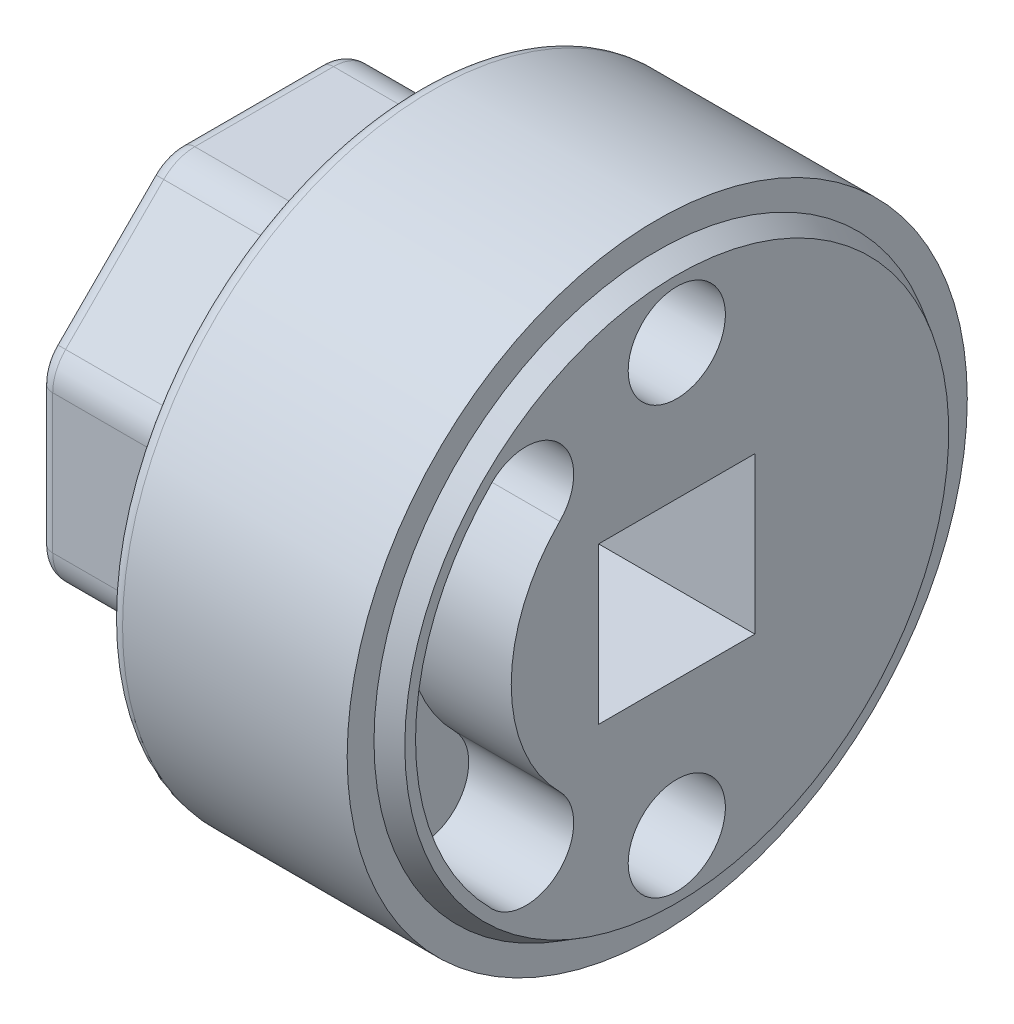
ISO-10303-21;
HEADER;
FILE_DESCRIPTION(('STEP AP214'),'2;1');
FILE_NAME('part.step','',(''),(''),'','','');
FILE_SCHEMA(('AUTOMOTIVE_DESIGN { 1 0 10303 214 1 1 1 1 }'));
ENDSEC;
DATA;
#1=APPLICATION_CONTEXT('core data for automotive mechanical design processes');
#2=APPLICATION_PROTOCOL_DEFINITION('international standard','automotive_design',2000,#1);
#3=PRODUCT_CONTEXT('',#1,'mechanical');
#4=PRODUCT('Part','Part','',(#3));
#5=PRODUCT_RELATED_PRODUCT_CATEGORY('part','',(#4));
#6=PRODUCT_DEFINITION_FORMATION('','',#4);
#7=PRODUCT_DEFINITION_CONTEXT('part definition',#1,'design');
#8=PRODUCT_DEFINITION('design','',#6,#7);
#9=PRODUCT_DEFINITION_SHAPE('','',#8);
#10=(LENGTH_UNIT() NAMED_UNIT(*) SI_UNIT(.MILLI.,.METRE.));
#11=(NAMED_UNIT(*) PLANE_ANGLE_UNIT() SI_UNIT($,.RADIAN.));
#12=(NAMED_UNIT(*) SI_UNIT($,.STERADIAN.) SOLID_ANGLE_UNIT());
#13=UNCERTAINTY_MEASURE_WITH_UNIT(LENGTH_MEASURE(1.E-05),#10,'distance_accuracy_value','');
#14=(GEOMETRIC_REPRESENTATION_CONTEXT(3) GLOBAL_UNCERTAINTY_ASSIGNED_CONTEXT((#13)) GLOBAL_UNIT_ASSIGNED_CONTEXT((#10,
#11,#12)) REPRESENTATION_CONTEXT('',''));
#15=CARTESIAN_POINT('',(0.,0.,0.));
#16=DIRECTION('',(0.,0.,1.));
#17=DIRECTION('',(1.,0.,0.));
#18=AXIS2_PLACEMENT_3D('',#15,#16,#17);
#19=CARTESIAN_POINT('',(8.636,0.,0.));
#20=DIRECTION('',(-1.,0.,0.));
#21=DIRECTION('',(0.,0.,1.));
#22=AXIS2_PLACEMENT_3D('',#19,#20,#21);
#23=PLANE('',#22);
#24=CARTESIAN_POINT('',(8.636,0.,0.));
#25=DIRECTION('',(-1.,0.,0.));
#26=DIRECTION('',(0.,0.,1.));
#27=AXIS2_PLACEMENT_3D('',#24,#25,#26);
#28=CIRCLE('',#27,2.5908);
#29=CARTESIAN_POINT('',(8.636,0.,2.5908));
#30=VERTEX_POINT('',#29);
#31=EDGE_CURVE('E869',#30,#30,#28,.F.);
#32=ORIENTED_EDGE('',*,*,#31,.T.);
#33=EDGE_LOOP('',(#32));
#34=FACE_BOUND('',#33,.T.);
#35=CARTESIAN_POINT('',(8.636,0.,0.));
#36=DIRECTION('',(-1.,0.,0.));
#37=DIRECTION('',(0.,0.,1.));
#38=AXIS2_PLACEMENT_3D('',#35,#36,#37);
#39=CIRCLE('',#38,6.35);
#40=CARTESIAN_POINT('',(8.636,0.,6.35));
#41=VERTEX_POINT('',#40);
#42=EDGE_CURVE('E873',#41,#41,#39,.T.);
#43=ORIENTED_EDGE('',*,*,#42,.T.);
#44=EDGE_LOOP('',(#43));
#45=FACE_BOUND('',#44,.T.);
#46=ADVANCED_FACE('F17',(#34,#45),#23,.T.);
#47=CARTESIAN_POINT('',(28.3045451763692,0.,0.));
#48=DIRECTION('',(-1.,0.,0.));
#49=DIRECTION('',(0.,0.,1.));
#50=AXIS2_PLACEMENT_3D('',#47,#48,#49);
#51=CYLINDRICAL_SURFACE('',#50,6.35);
#52=ORIENTED_EDGE('',*,*,#42,.F.);
#53=EDGE_LOOP('',(#52));
#54=FACE_BOUND('',#53,.T.);
#55=CARTESIAN_POINT('',(0.,0.,0.));
#56=DIRECTION('',(-1.,0.,0.));
#57=DIRECTION('',(0.,0.,1.));
#58=AXIS2_PLACEMENT_3D('',#55,#56,#57);
#59=CIRCLE('',#58,6.35);
#60=CARTESIAN_POINT('',(0.,0.,6.35));
#61=VERTEX_POINT('',#60);
#62=EDGE_CURVE('E865',#61,#61,#59,.F.);
#63=ORIENTED_EDGE('',*,*,#62,.F.);
#64=EDGE_LOOP('',(#63));
#65=FACE_BOUND('',#64,.T.);
#66=ADVANCED_FACE('F1489',(#54,#65),#51,.F.);
#67=CARTESIAN_POINT('',(28.3045451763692,0.,0.));
#68=DIRECTION('',(-1.,0.,0.));
#69=DIRECTION('',(0.,0.,1.));
#70=AXIS2_PLACEMENT_3D('',#67,#68,#69);
#71=CYLINDRICAL_SURFACE('',#70,2.5908);
#72=ORIENTED_EDGE('',*,*,#31,.F.);
#73=EDGE_LOOP('',(#72));
#74=FACE_BOUND('',#73,.T.);
#75=CARTESIAN_POINT('',(10.7188,0.,0.));
#76=DIRECTION('',(-1.,0.,0.));
#77=DIRECTION('',(0.,0.,1.));
#78=AXIS2_PLACEMENT_3D('',#75,#76,#77);
#79=CIRCLE('',#78,2.5908);
#80=CARTESIAN_POINT('',(10.7188,0.,2.5908));
#81=VERTEX_POINT('',#80);
#82=EDGE_CURVE('E861',#81,#81,#79,.T.);
#83=ORIENTED_EDGE('',*,*,#82,.F.);
#84=EDGE_LOOP('',(#83));
#85=FACE_BOUND('',#84,.T.);
#86=ADVANCED_FACE('F678',(#74,#85),#71,.F.);
#87=CARTESIAN_POINT('',(0.,0.,0.));
#88=DIRECTION('',(-1.,0.,0.));
#89=DIRECTION('',(0.,0.,1.));
#90=AXIS2_PLACEMENT_3D('',#87,#88,#89);
#91=PLANE('',#90);
#92=ORIENTED_EDGE('',*,*,#62,.T.);
#93=EDGE_LOOP('',(#92));
#94=FACE_BOUND('',#93,.T.);
#95=DIRECTION('',(0.,-0.707106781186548,-0.707106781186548));
#96=VECTOR('',#95,1.);
#97=CARTESIAN_POINT('',(3.77410776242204E-13,9.86823025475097,-4.60794368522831));
#98=LINE('',#97,#96);
#99=CARTESIAN_POINT('',(2.83139397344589E-13,4.68634266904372,-9.78983127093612));
#100=VERTEX_POINT('',#99);
#101=CARTESIAN_POINT('',(2.1225968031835E-13,9.7898312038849,-4.6863426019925));
#102=VERTEX_POINT('',#101);
#103=EDGE_CURVE('E385',#100,#102,#98,.F.);
#104=ORIENTED_EDGE('',*,*,#103,.F.);
#105=CARTESIAN_POINT('',(3.77519196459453E-13,3.6087113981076,-8.7122));
#106=DIRECTION('',(1.,0.,0.));
#107=DIRECTION('',(0.,0.,-1.));
#108=AXIS2_PLACEMENT_3D('',#105,#106,#107);
#109=CIRCLE('',#108,1.5240007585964);
#110=CARTESIAN_POINT('',(1.18015406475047E-13,3.6087113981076,-10.2362004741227));
#111=VERTEX_POINT('',#110);
#112=EDGE_CURVE('E400',#111,#100,#109,.T.);
#113=ORIENTED_EDGE('',*,*,#112,.F.);
#114=DIRECTION('',(0.,-1.,0.));
#115=VECTOR('',#114,1.);
#116=CARTESIAN_POINT('',(0.,3.71958430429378,-10.2362));
#117=LINE('',#116,#115);
#118=CARTESIAN_POINT('',(0.,-3.60871139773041,-10.2362001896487));
#119=VERTEX_POINT('',#118);
#120=EDGE_CURVE('E405',#119,#111,#117,.F.);
#121=ORIENTED_EDGE('',*,*,#120,.F.);
#122=CARTESIAN_POINT('',(3.77410776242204E-13,-3.6087113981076,-8.7122));
#123=DIRECTION('',(1.,0.,0.));
#124=DIRECTION('',(0.,-0.707106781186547,-0.707106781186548));
#125=AXIS2_PLACEMENT_3D('',#122,#123,#124);
#126=CIRCLE('',#125,1.52400075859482);
#127=CARTESIAN_POINT('',(1.17852776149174E-13,-4.68634246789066,-9.78983106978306));
#128=VERTEX_POINT('',#127);
#129=EDGE_CURVE('E447',#128,#119,#126,.T.);
#130=ORIENTED_EDGE('',*,*,#129,.F.);
#131=DIRECTION('',(0.,-0.707106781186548,0.707106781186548));
#132=VECTOR('',#131,1.);
#133=CARTESIAN_POINT('',(0.,-4.60794314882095,-9.86822971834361));
#134=LINE('',#133,#132);
#135=CARTESIAN_POINT('',(0.,-9.78983086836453,-4.68634226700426));
#136=VERTEX_POINT('',#135);
#137=EDGE_CURVE('E466',#136,#128,#134,.F.);
#138=ORIENTED_EDGE('',*,*,#137,.F.);
#139=CARTESIAN_POINT('',(3.77519196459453E-13,-8.7122,-3.6087113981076));
#140=DIRECTION('',(1.,0.,0.));
#141=DIRECTION('',(0.,-1.,0.));
#142=AXIS2_PLACEMENT_3D('',#139,#140,#141);
#143=CIRCLE('',#142,1.5240007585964);
#144=CARTESIAN_POINT('',(1.18015406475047E-13,-10.2362004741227,-3.6087113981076));
#145=VERTEX_POINT('',#144);
#146=EDGE_CURVE('E481',#145,#136,#143,.T.);
#147=ORIENTED_EDGE('',*,*,#146,.F.);
#148=DIRECTION('',(0.,0.,1.));
#149=VECTOR('',#148,1.);
#150=CARTESIAN_POINT('',(0.,-10.2362,-3.71958430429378));
#151=LINE('',#150,#149);
#152=CARTESIAN_POINT('',(0.,-10.2362001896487,3.60871139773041));
#153=VERTEX_POINT('',#152);
#154=EDGE_CURVE('E486',#153,#145,#151,.F.);
#155=ORIENTED_EDGE('',*,*,#154,.F.);
#156=CARTESIAN_POINT('',(3.77410776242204E-13,-8.7122,3.6087113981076));
#157=DIRECTION('',(1.,0.,0.));
#158=DIRECTION('',(0.,-0.707106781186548,0.707106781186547));
#159=AXIS2_PLACEMENT_3D('',#156,#157,#158);
#160=CIRCLE('',#159,1.52400075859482);
#161=CARTESIAN_POINT('',(1.17852776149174E-13,-9.78983106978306,4.68634246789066));
#162=VERTEX_POINT('',#161);
#163=EDGE_CURVE('E528',#162,#153,#160,.T.);
#164=ORIENTED_EDGE('',*,*,#163,.F.);
#165=DIRECTION('',(0.,0.707106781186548,0.707106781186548));
#166=VECTOR('',#165,1.);
#167=CARTESIAN_POINT('',(0.,-9.86822971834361,4.60794314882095));
#168=LINE('',#167,#166);
#169=CARTESIAN_POINT('',(0.,-4.68634226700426,9.78983086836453));
#170=VERTEX_POINT('',#169);
#171=EDGE_CURVE('E547',#170,#162,#168,.F.);
#172=ORIENTED_EDGE('',*,*,#171,.F.);
#173=CARTESIAN_POINT('',(3.77519196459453E-13,-3.6087113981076,8.7122));
#174=DIRECTION('',(1.,0.,0.));
#175=DIRECTION('',(0.,0.,1.));
#176=AXIS2_PLACEMENT_3D('',#173,#174,#175);
#177=CIRCLE('',#176,1.5240007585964);
#178=CARTESIAN_POINT('',(1.18015406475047E-13,-3.6087113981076,10.2362004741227));
#179=VERTEX_POINT('',#178);
#180=EDGE_CURVE('E562',#179,#170,#177,.T.);
#181=ORIENTED_EDGE('',*,*,#180,.F.);
#182=DIRECTION('',(0.,1.,0.));
#183=VECTOR('',#182,1.);
#184=CARTESIAN_POINT('',(0.,-3.71958430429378,10.2362));
#185=LINE('',#184,#183);
#186=CARTESIAN_POINT('',(0.,3.60871139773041,10.2362001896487));
#187=VERTEX_POINT('',#186);
#188=EDGE_CURVE('E567',#187,#179,#185,.F.);
#189=ORIENTED_EDGE('',*,*,#188,.F.);
#190=CARTESIAN_POINT('',(3.77410776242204E-13,3.6087113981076,8.7122));
#191=DIRECTION('',(1.,0.,0.));
#192=DIRECTION('',(0.,0.707106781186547,0.707106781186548));
#193=AXIS2_PLACEMENT_3D('',#190,#191,#192);
#194=CIRCLE('',#193,1.52400075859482);
#195=CARTESIAN_POINT('',(1.17852776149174E-13,4.68634246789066,9.78983106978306));
#196=VERTEX_POINT('',#195);
#197=EDGE_CURVE('E603',#196,#187,#194,.T.);
#198=ORIENTED_EDGE('',*,*,#197,.F.);
#199=DIRECTION('',(0.,0.707106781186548,-0.707106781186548));
#200=VECTOR('',#199,1.);
#201=CARTESIAN_POINT('',(0.,4.60794314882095,9.86822971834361));
#202=LINE('',#201,#200);
#203=CARTESIAN_POINT('',(0.,9.78983086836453,4.68634226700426));
#204=VERTEX_POINT('',#203);
#205=EDGE_CURVE('E622',#204,#196,#202,.F.);
#206=ORIENTED_EDGE('',*,*,#205,.F.);
#207=CARTESIAN_POINT('',(3.77519196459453E-13,8.7122,3.6087113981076));
#208=DIRECTION('',(1.,0.,0.));
#209=DIRECTION('',(0.,1.,0.));
#210=AXIS2_PLACEMENT_3D('',#207,#208,#209);
#211=CIRCLE('',#210,1.5240007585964);
#212=CARTESIAN_POINT('',(0.,10.2362004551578,3.6087113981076));
#213=VERTEX_POINT('',#212);
#214=EDGE_CURVE('E636',#213,#204,#211,.T.);
#215=ORIENTED_EDGE('',*,*,#214,.F.);
#216=DIRECTION('',(0.,0.,1.));
#217=VECTOR('',#216,1.);
#218=CARTESIAN_POINT('',(0.,10.2362007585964,0.));
#219=LINE('',#218,#217);
#220=CARTESIAN_POINT('',(0.,10.2362003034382,-3.6087113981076));
#221=VERTEX_POINT('',#220);
#222=EDGE_CURVE('E296',#221,#213,#219,.T.);
#223=ORIENTED_EDGE('',*,*,#222,.F.);
#224=CARTESIAN_POINT('',(3.77410776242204E-13,8.7122,-3.6087113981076));
#225=DIRECTION('',(1.,0.,0.));
#226=DIRECTION('',(0.,0.707106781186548,-0.707106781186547));
#227=AXIS2_PLACEMENT_3D('',#224,#225,#226);
#228=CIRCLE('',#227,1.52400075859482);
#229=EDGE_CURVE('E361',#102,#221,#228,.T.);
#230=ORIENTED_EDGE('',*,*,#229,.F.);
#231=EDGE_LOOP('',(#104,#113,#121,#130,#138,#147,#155,#164,#172,#181,#189,#198,#206,#215,#223,#230));
#232=FACE_BOUND('',#231,.T.);
#233=ADVANCED_FACE('F668',(#94,#232),#91,.T.);
#234=CARTESIAN_POINT('',(16.764,0.,0.));
#235=DIRECTION('',(1.,0.,0.));
#236=DIRECTION('',(0.,0.,-1.));
#237=AXIS2_PLACEMENT_3D('',#234,#235,#236);
#238=PLANE('',#237);
#239=CARTESIAN_POINT('',(16.764,0.,0.));
#240=DIRECTION('',(1.,0.,0.));
#241=DIRECTION('',(0.,0.,-1.));
#242=AXIS2_PLACEMENT_3D('',#239,#240,#241);
#243=CIRCLE('',#242,8.6106);
#244=CARTESIAN_POINT('',(16.764,6.08861365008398,6.08861365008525));
#245=VERTEX_POINT('',#244);
#246=CARTESIAN_POINT('',(16.764,-6.08861365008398,6.08861365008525));
#247=VERTEX_POINT('',#246);
#248=EDGE_CURVE('E299',#245,#247,#243,.T.);
#249=ORIENTED_EDGE('',*,*,#248,.F.);
#250=CARTESIAN_POINT('',(16.764,7.8487438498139,7.8487438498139));
#251=DIRECTION('',(1.,0.,0.));
#252=DIRECTION('',(0.,0.,-1.));
#253=AXIS2_PLACEMENT_3D('',#250,#251,#252);
#254=CIRCLE('',#253,2.4892);
#255=CARTESIAN_POINT('',(16.764,9.60887404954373,9.60887404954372));
#256=VERTEX_POINT('',#255);
#257=EDGE_CURVE('E285',#245,#256,#254,.T.);
#258=ORIENTED_EDGE('',*,*,#257,.T.);
#259=CARTESIAN_POINT('',(16.764,0.,0.));
#260=DIRECTION('',(1.,0.,0.));
#261=DIRECTION('',(0.,0.,-1.));
#262=AXIS2_PLACEMENT_3D('',#259,#260,#261);
#263=CIRCLE('',#262,13.589);
#264=CARTESIAN_POINT('',(16.764,-9.60887404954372,9.60887404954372));
#265=VERTEX_POINT('',#264);
#266=EDGE_CURVE('E326',#256,#265,#263,.T.);
#267=ORIENTED_EDGE('',*,*,#266,.T.);
#268=CARTESIAN_POINT('',(16.764,-7.8487438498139,7.8487438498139));
#269=DIRECTION('',(1.,0.,0.));
#270=DIRECTION('',(0.,0.,-1.));
#271=AXIS2_PLACEMENT_3D('',#268,#269,#270);
#272=CIRCLE('',#271,2.4892);
#273=EDGE_CURVE('E302',#265,#247,#272,.T.);
#274=ORIENTED_EDGE('',*,*,#273,.T.);
#275=EDGE_LOOP('',(#249,#258,#267,#274));
#276=FACE_BOUND('',#275,.T.);
#277=ADVANCED_FACE('F300',(#276),#238,.T.);
#278=CARTESIAN_POINT('',(14.478,-11.0998,0.));
#279=DIRECTION('',(-1.,0.,0.));
#280=DIRECTION('',(0.,0.,1.));
#281=AXIS2_PLACEMENT_3D('',#278,#279,#280);
#282=PLANE('',#281);
#283=CARTESIAN_POINT('',(14.478,-11.0998,0.));
#284=DIRECTION('',(-1.,0.,0.));
#285=DIRECTION('',(0.,0.,1.));
#286=AXIS2_PLACEMENT_3D('',#283,#284,#285);
#287=CIRCLE('',#286,2.5273);
#288=CARTESIAN_POINT('',(14.478,-11.0998,2.5273));
#289=VERTEX_POINT('',#288);
#290=EDGE_CURVE('E842',#289,#289,#287,.F.);
#291=ORIENTED_EDGE('',*,*,#290,.T.);
#292=EDGE_LOOP('',(#291));
#293=FACE_BOUND('',#292,.T.);
#294=ADVANCED_FACE('F1496',(#293),#282,.F.);
#295=CARTESIAN_POINT('',(14.478,11.0998,0.));
#296=DIRECTION('',(-1.,0.,0.));
#297=DIRECTION('',(0.,0.,1.));
#298=AXIS2_PLACEMENT_3D('',#295,#296,#297);
#299=PLANE('',#298);
#300=CARTESIAN_POINT('',(14.478,11.0998,0.));
#301=DIRECTION('',(-1.,0.,0.));
#302=DIRECTION('',(0.,0.,1.));
#303=AXIS2_PLACEMENT_3D('',#300,#301,#302);
#304=CIRCLE('',#303,2.5273);
#305=CARTESIAN_POINT('',(14.478,11.0998,2.5273));
#306=VERTEX_POINT('',#305);
#307=EDGE_CURVE('E836',#306,#306,#304,.F.);
#308=ORIENTED_EDGE('',*,*,#307,.T.);
#309=EDGE_LOOP('',(#308));
#310=FACE_BOUND('',#309,.T.);
#311=ADVANCED_FACE('F1498',(#310),#299,.F.);
#312=CARTESIAN_POINT('',(10.7188,0.,0.));
#313=DIRECTION('',(1.,0.,0.));
#314=DIRECTION('',(0.,0.,-1.));
#315=AXIS2_PLACEMENT_3D('',#312,#313,#314);
#316=PLANE('',#315);
#317=ORIENTED_EDGE('',*,*,#82,.T.);
#318=EDGE_LOOP('',(#317));
#319=FACE_BOUND('',#318,.T.);
#320=DIRECTION('',(0.,0.,1.));
#321=VECTOR('',#320,1.);
#322=CARTESIAN_POINT('',(10.7188,4.064,-4.064));
#323=LINE('',#322,#321);
#324=CARTESIAN_POINT('',(10.7188,4.064,-4.064));
#325=VERTEX_POINT('',#324);
#326=CARTESIAN_POINT('',(10.7188,4.064,4.064));
#327=VERTEX_POINT('',#326);
#328=EDGE_CURVE('E821',#325,#327,#323,.T.);
#329=ORIENTED_EDGE('',*,*,#328,.T.);
#330=DIRECTION('',(0.,1.,0.));
#331=VECTOR('',#330,1.);
#332=CARTESIAN_POINT('',(10.7188,4.064,4.064));
#333=LINE('',#332,#331);
#334=CARTESIAN_POINT('',(10.7188,-4.064,4.064));
#335=VERTEX_POINT('',#334);
#336=EDGE_CURVE('E814',#327,#335,#333,.F.);
#337=ORIENTED_EDGE('',*,*,#336,.T.);
#338=DIRECTION('',(0.,0.,-1.));
#339=VECTOR('',#338,1.);
#340=CARTESIAN_POINT('',(10.7188,-4.064,4.064));
#341=LINE('',#340,#339);
#342=CARTESIAN_POINT('',(10.7188,-4.064,-4.064));
#343=VERTEX_POINT('',#342);
#344=EDGE_CURVE('E834',#335,#343,#341,.T.);
#345=ORIENTED_EDGE('',*,*,#344,.T.);
#346=DIRECTION('',(0.,1.,0.));
#347=VECTOR('',#346,1.);
#348=CARTESIAN_POINT('',(10.7188,-4.064,-4.064));
#349=LINE('',#348,#347);
#350=EDGE_CURVE('E828',#343,#325,#349,.T.);
#351=ORIENTED_EDGE('',*,*,#350,.T.);
#352=EDGE_LOOP('',(#329,#337,#345,#351));
#353=FACE_BOUND('',#352,.T.);
#354=ADVANCED_FACE('F651',(#319,#353),#316,.T.);
#355=CARTESIAN_POINT('',(0.762,8.7122,3.6087113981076));
#356=DIRECTION('',(-1.,0.,0.));
#357=DIRECTION('',(0.,0.682557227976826,0.730832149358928));
#358=AXIS2_PLACEMENT_3D('',#355,#356,#357);
#359=TOROIDAL_SURFACE('',#358,1.524,0.762);
#360=CARTESIAN_POINT('',(0.762,10.2362,3.6087113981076));
#361=DIRECTION('',(0.,0.,-1.));
#362=DIRECTION('',(-1.,0.,0.));
#363=AXIS2_PLACEMENT_3D('',#360,#361,#362);
#364=CIRCLE('',#363,0.762);
#365=CARTESIAN_POINT('',(0.762,10.9982,3.6087113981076));
#366=VERTEX_POINT('',#365);
#367=EDGE_CURVE('E355',#213,#366,#364,.T.);
#368=ORIENTED_EDGE('',*,*,#367,.F.);
#369=ORIENTED_EDGE('',*,*,#214,.T.);
#370=CARTESIAN_POINT('',(0.762,9.78983073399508,4.68634213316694));
#371=DIRECTION('',(0.,0.707106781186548,-0.707106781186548));
#372=DIRECTION('',(0.,0.707106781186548,0.707106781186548));
#373=AXIS2_PLACEMENT_3D('',#370,#371,#372);
#374=CIRCLE('',#373,0.762);
#375=CARTESIAN_POINT('',(0.762,10.3286461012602,5.22515750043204));
#376=VERTEX_POINT('',#375);
#377=EDGE_CURVE('E630',#376,#204,#374,.F.);
#378=ORIENTED_EDGE('',*,*,#377,.F.);
#379=CARTESIAN_POINT('',(0.762000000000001,8.7122,3.6087113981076));
#380=DIRECTION('',(-1.,0.,0.));
#381=DIRECTION('',(0.,0.,1.));
#382=AXIS2_PLACEMENT_3D('',#379,#380,#381);
#383=CIRCLE('',#382,2.286);
#384=EDGE_CURVE('E329',#366,#376,#383,.F.);
#385=ORIENTED_EDGE('',*,*,#384,.F.);
#386=EDGE_LOOP('',(#368,#369,#378,#385));
#387=FACE_BOUND('',#386,.T.);
#388=ADVANCED_FACE('F641',(#387),#359,.T.);
#389=CARTESIAN_POINT('',(0.762,4.60794314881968,9.86822971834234));
#390=DIRECTION('',(0.,0.707106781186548,-0.707106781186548));
#391=DIRECTION('',(0.,0.707106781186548,0.707106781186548));
#392=AXIS2_PLACEMENT_3D('',#389,#390,#391);
#393=CYLINDRICAL_SURFACE('',#392,0.762);
#394=ORIENTED_EDGE('',*,*,#377,.T.);
#395=ORIENTED_EDGE('',*,*,#205,.T.);
#396=CARTESIAN_POINT('',(0.762,4.6863421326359,9.7898307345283));
#397=DIRECTION('',(0.,0.707106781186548,-0.707106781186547));
#398=DIRECTION('',(0.,0.707106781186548,0.707106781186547));
#399=AXIS2_PLACEMENT_3D('',#396,#397,#398);
#400=CIRCLE('',#399,0.762);
#401=CARTESIAN_POINT('',(0.762000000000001,5.22515749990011,10.3286461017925));
#402=VERTEX_POINT('',#401);
#403=EDGE_CURVE('E608',#402,#196,#400,.F.);
#404=ORIENTED_EDGE('',*,*,#403,.F.);
#405=DIRECTION('',(0.,0.707106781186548,-0.707106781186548));
#406=VECTOR('',#405,1.);
#407=CARTESIAN_POINT('',(0.762,10.9982,4.55560360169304));
#408=LINE('',#407,#406);
#409=EDGE_CURVE('E333',#402,#376,#408,.T.);
#410=ORIENTED_EDGE('',*,*,#409,.T.);
#411=EDGE_LOOP('',(#394,#395,#404,#410));
#412=FACE_BOUND('',#411,.T.);
#413=ADVANCED_FACE('F614',(#412),#393,.T.);
#414=CARTESIAN_POINT('',(0.762,3.6087113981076,8.7122));
#415=DIRECTION('',(-1.,0.,0.));
#416=DIRECTION('',(0.,-0.0341355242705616,0.999417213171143));
#417=AXIS2_PLACEMENT_3D('',#414,#415,#416);
#418=TOROIDAL_SURFACE('',#417,1.524,0.762);
#419=ORIENTED_EDGE('',*,*,#403,.T.);
#420=ORIENTED_EDGE('',*,*,#197,.T.);
#421=CARTESIAN_POINT('',(0.762,3.60871139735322,10.2362));
#422=DIRECTION('',(0.,1.,0.));
#423=DIRECTION('',(0.,0.,1.));
#424=AXIS2_PLACEMENT_3D('',#421,#422,#423);
#425=CIRCLE('',#424,0.762);
#426=CARTESIAN_POINT('',(0.762,3.60871139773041,10.9982));
#427=VERTEX_POINT('',#426);
#428=EDGE_CURVE('E599',#427,#187,#425,.F.);
#429=ORIENTED_EDGE('',*,*,#428,.F.);
#430=CARTESIAN_POINT('',(0.762000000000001,3.6087113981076,8.7122));
#431=DIRECTION('',(-1.,0.,0.));
#432=DIRECTION('',(0.,0.,1.));
#433=AXIS2_PLACEMENT_3D('',#430,#431,#432);
#434=CIRCLE('',#433,2.286);
#435=EDGE_CURVE('E596',#402,#427,#434,.F.);
#436=ORIENTED_EDGE('',*,*,#435,.F.);
#437=EDGE_LOOP('',(#419,#420,#429,#436));
#438=FACE_BOUND('',#437,.T.);
#439=ADVANCED_FACE('F610',(#438),#418,.T.);
#440=CARTESIAN_POINT('',(0.762,-3.71958430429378,10.2362));
#441=DIRECTION('',(0.,1.,0.));
#442=DIRECTION('',(0.,0.,1.));
#443=AXIS2_PLACEMENT_3D('',#440,#441,#442);
#444=CYLINDRICAL_SURFACE('',#443,0.762);
#445=ORIENTED_EDGE('',*,*,#428,.T.);
#446=ORIENTED_EDGE('',*,*,#188,.T.);
#447=CARTESIAN_POINT('',(0.762,-3.6087113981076,10.2362));
#448=DIRECTION('',(0.,1.,0.));
#449=DIRECTION('',(0.,0.,1.));
#450=AXIS2_PLACEMENT_3D('',#447,#448,#449);
#451=CIRCLE('',#450,0.762);
#452=CARTESIAN_POINT('',(0.762,-3.6087113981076,10.9982));
#453=VERTEX_POINT('',#452);
#454=EDGE_CURVE('E586',#453,#179,#451,.F.);
#455=ORIENTED_EDGE('',*,*,#454,.F.);
#456=DIRECTION('',(0.,1.,0.));
#457=VECTOR('',#456,1.);
#458=CARTESIAN_POINT('',(0.762,4.55560360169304,10.9982));
#459=LINE('',#458,#457);
#460=EDGE_CURVE('E591',#453,#427,#459,.T.);
#461=ORIENTED_EDGE('',*,*,#460,.T.);
#462=EDGE_LOOP('',(#445,#446,#455,#461));
#463=FACE_BOUND('',#462,.T.);
#464=ADVANCED_FACE('F579',(#463),#444,.T.);
#465=CARTESIAN_POINT('',(0.762,-3.6087113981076,8.7122));
#466=DIRECTION('',(-1.,0.,0.));
#467=DIRECTION('',(0.,-0.730832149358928,0.682557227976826));
#468=AXIS2_PLACEMENT_3D('',#465,#466,#467);
#469=TOROIDAL_SURFACE('',#468,1.524,0.762);
#470=ORIENTED_EDGE('',*,*,#454,.T.);
#471=ORIENTED_EDGE('',*,*,#180,.T.);
#472=CARTESIAN_POINT('',(0.762,-4.68634213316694,9.78983073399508));
#473=DIRECTION('',(0.,0.707106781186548,0.707106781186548));
#474=DIRECTION('',(0.,-0.707106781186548,0.707106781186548));
#475=AXIS2_PLACEMENT_3D('',#472,#473,#474);
#476=CIRCLE('',#475,0.762);
#477=CARTESIAN_POINT('',(0.762,-5.22515750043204,10.3286461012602));
#478=VERTEX_POINT('',#477);
#479=EDGE_CURVE('E555',#478,#170,#476,.F.);
#480=ORIENTED_EDGE('',*,*,#479,.F.);
#481=CARTESIAN_POINT('',(0.762000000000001,-3.6087113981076,8.7122));
#482=DIRECTION('',(-1.,0.,0.));
#483=DIRECTION('',(0.,0.,1.));
#484=AXIS2_PLACEMENT_3D('',#481,#482,#483);
#485=CIRCLE('',#484,2.286);
#486=EDGE_CURVE('E792',#453,#478,#485,.F.);
#487=ORIENTED_EDGE('',*,*,#486,.F.);
#488=EDGE_LOOP('',(#470,#471,#480,#487));
#489=FACE_BOUND('',#488,.T.);
#490=ADVANCED_FACE('F569',(#489),#469,.T.);
#491=CARTESIAN_POINT('',(0.762,-9.86822971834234,4.60794314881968));
#492=DIRECTION('',(0.,0.707106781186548,0.707106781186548));
#493=DIRECTION('',(0.,-0.707106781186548,0.707106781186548));
#494=AXIS2_PLACEMENT_3D('',#491,#492,#493);
#495=CYLINDRICAL_SURFACE('',#494,0.762);
#496=ORIENTED_EDGE('',*,*,#479,.T.);
#497=ORIENTED_EDGE('',*,*,#171,.T.);
#498=CARTESIAN_POINT('',(0.762,-9.7898307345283,4.6863421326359));
#499=DIRECTION('',(0.,0.707106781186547,0.707106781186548));
#500=DIRECTION('',(0.,-0.707106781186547,0.707106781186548));
#501=AXIS2_PLACEMENT_3D('',#498,#499,#500);
#502=CIRCLE('',#501,0.762);
#503=CARTESIAN_POINT('',(0.762000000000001,-10.3286461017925,5.22515749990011));
#504=VERTEX_POINT('',#503);
#505=EDGE_CURVE('E533',#504,#162,#502,.F.);
#506=ORIENTED_EDGE('',*,*,#505,.F.);
#507=DIRECTION('',(0.,0.707106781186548,0.707106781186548));
#508=VECTOR('',#507,1.);
#509=CARTESIAN_POINT('',(0.762,-4.55560360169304,10.9982));
#510=LINE('',#509,#508);
#511=EDGE_CURVE('E785',#504,#478,#510,.T.);
#512=ORIENTED_EDGE('',*,*,#511,.T.);
#513=EDGE_LOOP('',(#496,#497,#506,#512));
#514=FACE_BOUND('',#513,.T.);
#515=ADVANCED_FACE('F539',(#514),#495,.T.);
#516=CARTESIAN_POINT('',(0.762,-8.7122,3.6087113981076));
#517=DIRECTION('',(-1.,0.,0.));
#518=DIRECTION('',(0.,-0.999417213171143,-0.0341355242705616));
#519=AXIS2_PLACEMENT_3D('',#516,#517,#518);
#520=TOROIDAL_SURFACE('',#519,1.524,0.762);
#521=ORIENTED_EDGE('',*,*,#505,.T.);
#522=ORIENTED_EDGE('',*,*,#163,.T.);
#523=CARTESIAN_POINT('',(0.762,-10.2362,3.60871139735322));
#524=DIRECTION('',(0.,0.,1.));
#525=DIRECTION('',(1.,0.,0.));
#526=AXIS2_PLACEMENT_3D('',#523,#524,#525);
#527=CIRCLE('',#526,0.762);
#528=CARTESIAN_POINT('',(0.762,-10.9982,3.60871139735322));
#529=VERTEX_POINT('',#528);
#530=EDGE_CURVE('E524',#529,#153,#527,.F.);
#531=ORIENTED_EDGE('',*,*,#530,.F.);
#532=CARTESIAN_POINT('',(0.762000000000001,-8.7122,3.6087113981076));
#533=DIRECTION('',(-1.,0.,0.));
#534=DIRECTION('',(0.,0.,1.));
#535=AXIS2_PLACEMENT_3D('',#532,#533,#534);
#536=CIRCLE('',#535,2.286);
#537=EDGE_CURVE('E515',#504,#529,#536,.F.);
#538=ORIENTED_EDGE('',*,*,#537,.F.);
#539=EDGE_LOOP('',(#521,#522,#531,#538));
#540=FACE_BOUND('',#539,.T.);
#541=ADVANCED_FACE('F535',(#540),#520,.T.);
#542=CARTESIAN_POINT('',(0.762,-10.2362,-3.71958430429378));
#543=DIRECTION('',(0.,0.,1.));
#544=DIRECTION('',(1.,0.,0.));
#545=AXIS2_PLACEMENT_3D('',#542,#543,#544);
#546=CYLINDRICAL_SURFACE('',#545,0.762);
#547=ORIENTED_EDGE('',*,*,#530,.T.);
#548=ORIENTED_EDGE('',*,*,#154,.T.);
#549=CARTESIAN_POINT('',(0.762,-10.2362,-3.6087113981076));
#550=DIRECTION('',(0.,0.,1.));
#551=DIRECTION('',(0.,-1.,0.));
#552=AXIS2_PLACEMENT_3D('',#549,#550,#551);
#553=CIRCLE('',#552,0.762);
#554=CARTESIAN_POINT('',(0.762,-10.9982,-3.6087113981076));
#555=VERTEX_POINT('',#554);
#556=EDGE_CURVE('E505',#555,#145,#553,.F.);
#557=ORIENTED_EDGE('',*,*,#556,.F.);
#558=DIRECTION('',(0.,0.,1.));
#559=VECTOR('',#558,1.);
#560=CARTESIAN_POINT('',(0.762,-10.9982,4.55560360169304));
#561=LINE('',#560,#559);
#562=EDGE_CURVE('E510',#555,#529,#561,.T.);
#563=ORIENTED_EDGE('',*,*,#562,.T.);
#564=EDGE_LOOP('',(#547,#548,#557,#563));
#565=FACE_BOUND('',#564,.T.);
#566=ADVANCED_FACE('F498',(#565),#546,.T.);
#567=CARTESIAN_POINT('',(0.762,-8.7122,-3.6087113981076));
#568=DIRECTION('',(-1.,0.,0.));
#569=DIRECTION('',(0.,-0.682557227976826,-0.730832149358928));
#570=AXIS2_PLACEMENT_3D('',#567,#568,#569);
#571=TOROIDAL_SURFACE('',#570,1.524,0.762);
#572=ORIENTED_EDGE('',*,*,#556,.T.);
#573=ORIENTED_EDGE('',*,*,#146,.T.);
#574=CARTESIAN_POINT('',(0.762,-9.78983073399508,-4.68634213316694));
#575=DIRECTION('',(0.,-0.707106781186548,0.707106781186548));
#576=DIRECTION('',(0.,-0.707106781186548,-0.707106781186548));
#577=AXIS2_PLACEMENT_3D('',#574,#575,#576);
#578=CIRCLE('',#577,0.762);
#579=CARTESIAN_POINT('',(0.762,-10.3286461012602,-5.22515750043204));
#580=VERTEX_POINT('',#579);
#581=EDGE_CURVE('E474',#580,#136,#578,.F.);
#582=ORIENTED_EDGE('',*,*,#581,.F.);
#583=CARTESIAN_POINT('',(0.762000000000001,-8.7122,-3.6087113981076));
#584=DIRECTION('',(-1.,0.,0.));
#585=DIRECTION('',(0.,0.,1.));
#586=AXIS2_PLACEMENT_3D('',#583,#584,#585);
#587=CIRCLE('',#586,2.286);
#588=EDGE_CURVE('E771',#555,#580,#587,.F.);
#589=ORIENTED_EDGE('',*,*,#588,.F.);
#590=EDGE_LOOP('',(#572,#573,#582,#589));
#591=FACE_BOUND('',#590,.T.);
#592=ADVANCED_FACE('F488',(#591),#571,.T.);
#593=CARTESIAN_POINT('',(0.762,-4.60794314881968,-9.86822971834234));
#594=DIRECTION('',(0.,-0.707106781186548,0.707106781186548));
#595=DIRECTION('',(0.,-0.707106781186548,-0.707106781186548));
#596=AXIS2_PLACEMENT_3D('',#593,#594,#595);
#597=CYLINDRICAL_SURFACE('',#596,0.762);
#598=ORIENTED_EDGE('',*,*,#581,.T.);
#599=ORIENTED_EDGE('',*,*,#137,.T.);
#600=CARTESIAN_POINT('',(0.762,-4.6863421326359,-9.7898307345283));
#601=DIRECTION('',(0.,-0.707106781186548,0.707106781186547));
#602=DIRECTION('',(0.,-0.707106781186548,-0.707106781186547));
#603=AXIS2_PLACEMENT_3D('',#600,#601,#602);
#604=CIRCLE('',#603,0.762);
#605=CARTESIAN_POINT('',(0.762000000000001,-5.22515749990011,-10.3286461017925));
#606=VERTEX_POINT('',#605);
#607=EDGE_CURVE('E452',#606,#128,#604,.F.);
#608=ORIENTED_EDGE('',*,*,#607,.F.);
#609=DIRECTION('',(0.,-0.707106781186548,0.707106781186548));
#610=VECTOR('',#609,1.);
#611=CARTESIAN_POINT('',(0.762,-10.9982,-4.55560360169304));
#612=LINE('',#611,#610);
#613=EDGE_CURVE('E764',#606,#580,#612,.T.);
#614=ORIENTED_EDGE('',*,*,#613,.T.);
#615=EDGE_LOOP('',(#598,#599,#608,#614));
#616=FACE_BOUND('',#615,.T.);
#617=ADVANCED_FACE('F458',(#616),#597,.T.);
#618=CARTESIAN_POINT('',(0.762,-3.6087113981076,-8.7122));
#619=DIRECTION('',(-1.,0.,0.));
#620=DIRECTION('',(0.,0.0341355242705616,-0.999417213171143));
#621=AXIS2_PLACEMENT_3D('',#618,#619,#620);
#622=TOROIDAL_SURFACE('',#621,1.524,0.762);
#623=ORIENTED_EDGE('',*,*,#607,.T.);
#624=ORIENTED_EDGE('',*,*,#129,.T.);
#625=CARTESIAN_POINT('',(0.762,-3.60871139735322,-10.2362));
#626=DIRECTION('',(0.,-1.,0.));
#627=DIRECTION('',(0.,0.,-1.));
#628=AXIS2_PLACEMENT_3D('',#625,#626,#627);
#629=CIRCLE('',#628,0.762);
#630=CARTESIAN_POINT('',(0.762,-3.60871139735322,-10.9982));
#631=VERTEX_POINT('',#630);
#632=EDGE_CURVE('E443',#631,#119,#629,.F.);
#633=ORIENTED_EDGE('',*,*,#632,.F.);
#634=CARTESIAN_POINT('',(0.762000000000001,-3.6087113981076,-8.7122));
#635=DIRECTION('',(-1.,0.,0.));
#636=DIRECTION('',(0.,0.,1.));
#637=AXIS2_PLACEMENT_3D('',#634,#635,#636);
#638=CIRCLE('',#637,2.286);
#639=EDGE_CURVE('E434',#606,#631,#638,.F.);
#640=ORIENTED_EDGE('',*,*,#639,.F.);
#641=EDGE_LOOP('',(#623,#624,#633,#640));
#642=FACE_BOUND('',#641,.T.);
#643=ADVANCED_FACE('F454',(#642),#622,.T.);
#644=CARTESIAN_POINT('',(0.762,3.71958430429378,-10.2362));
#645=DIRECTION('',(0.,-1.,0.));
#646=DIRECTION('',(0.,0.,-1.));
#647=AXIS2_PLACEMENT_3D('',#644,#645,#646);
#648=CYLINDRICAL_SURFACE('',#647,0.762);
#649=ORIENTED_EDGE('',*,*,#632,.T.);
#650=ORIENTED_EDGE('',*,*,#120,.T.);
#651=CARTESIAN_POINT('',(0.762,3.6087113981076,-10.2362));
#652=DIRECTION('',(0.,-1.,0.));
#653=DIRECTION('',(0.,0.,-1.));
#654=AXIS2_PLACEMENT_3D('',#651,#652,#653);
#655=CIRCLE('',#654,0.762);
#656=CARTESIAN_POINT('',(0.762,3.6087113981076,-10.9982));
#657=VERTEX_POINT('',#656);
#658=EDGE_CURVE('E424',#657,#111,#655,.F.);
#659=ORIENTED_EDGE('',*,*,#658,.F.);
#660=DIRECTION('',(0.,1.,0.));
#661=VECTOR('',#660,1.);
#662=CARTESIAN_POINT('',(0.762,-4.55560360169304,-10.9982));
#663=LINE('',#662,#661);
#664=EDGE_CURVE('E429',#657,#631,#663,.F.);
#665=ORIENTED_EDGE('',*,*,#664,.T.);
#666=EDGE_LOOP('',(#649,#650,#659,#665));
#667=FACE_BOUND('',#666,.T.);
#668=ADVANCED_FACE('F417',(#667),#648,.T.);
#669=CARTESIAN_POINT('',(0.762,3.6087113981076,-8.7122));
#670=DIRECTION('',(-1.,0.,0.));
#671=DIRECTION('',(0.,0.730832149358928,-0.682557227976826));
#672=AXIS2_PLACEMENT_3D('',#669,#670,#671);
#673=TOROIDAL_SURFACE('',#672,1.524,0.762);
#674=ORIENTED_EDGE('',*,*,#658,.T.);
#675=ORIENTED_EDGE('',*,*,#112,.T.);
#676=CARTESIAN_POINT('',(0.762,4.68634213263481,-9.78983073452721));
#677=DIRECTION('',(0.,-0.707106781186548,-0.707106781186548));
#678=DIRECTION('',(0.,0.707106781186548,-0.707106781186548));
#679=AXIS2_PLACEMENT_3D('',#676,#677,#678);
#680=CIRCLE('',#679,0.762);
#681=CARTESIAN_POINT('',(0.762,5.22515749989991,-10.3286461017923));
#682=VERTEX_POINT('',#681);
#683=EDGE_CURVE('E393',#682,#100,#680,.F.);
#684=ORIENTED_EDGE('',*,*,#683,.F.);
#685=CARTESIAN_POINT('',(0.762000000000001,3.6087113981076,-8.7122));
#686=DIRECTION('',(-1.,0.,0.));
#687=DIRECTION('',(0.,0.,1.));
#688=AXIS2_PLACEMENT_3D('',#685,#686,#687);
#689=CIRCLE('',#688,2.286);
#690=EDGE_CURVE('E730',#657,#682,#689,.F.);
#691=ORIENTED_EDGE('',*,*,#690,.F.);
#692=EDGE_LOOP('',(#674,#675,#684,#691));
#693=FACE_BOUND('',#692,.T.);
#694=ADVANCED_FACE('F407',(#693),#673,.T.);
#695=CARTESIAN_POINT('',(0.762,9.86822971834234,-4.60794314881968));
#696=DIRECTION('',(0.,-0.707106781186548,-0.707106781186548));
#697=DIRECTION('',(0.,0.707106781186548,-0.707106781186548));
#698=AXIS2_PLACEMENT_3D('',#695,#696,#697);
#699=CYLINDRICAL_SURFACE('',#698,0.762);
#700=ORIENTED_EDGE('',*,*,#683,.T.);
#701=ORIENTED_EDGE('',*,*,#103,.T.);
#702=CARTESIAN_POINT('',(0.762,9.7898307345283,-4.6863421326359));
#703=DIRECTION('',(0.,-0.707106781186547,-0.707106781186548));
#704=DIRECTION('',(0.,0.707106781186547,-0.707106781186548));
#705=AXIS2_PLACEMENT_3D('',#702,#703,#704);
#706=CIRCLE('',#705,0.762);
#707=CARTESIAN_POINT('',(0.762000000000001,10.3286461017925,-5.22515749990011));
#708=VERTEX_POINT('',#707);
#709=EDGE_CURVE('E366',#708,#102,#706,.F.);
#710=ORIENTED_EDGE('',*,*,#709,.F.);
#711=DIRECTION('',(0.,-0.707106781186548,-0.707106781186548));
#712=VECTOR('',#711,1.);
#713=CARTESIAN_POINT('',(0.762,4.55560360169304,-10.9982));
#714=LINE('',#713,#712);
#715=EDGE_CURVE('E1050',#708,#682,#714,.T.);
#716=ORIENTED_EDGE('',*,*,#715,.T.);
#717=EDGE_LOOP('',(#700,#701,#710,#716));
#718=FACE_BOUND('',#717,.T.);
#719=ADVANCED_FACE('F375',(#718),#699,.T.);
#720=CARTESIAN_POINT('',(0.762,8.7122,-3.6087113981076));
#721=DIRECTION('',(-1.,0.,0.));
#722=DIRECTION('',(0.,0.999417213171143,0.0341355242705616));
#723=AXIS2_PLACEMENT_3D('',#720,#721,#722);
#724=TOROIDAL_SURFACE('',#723,1.524,0.762);
#725=ORIENTED_EDGE('',*,*,#709,.T.);
#726=ORIENTED_EDGE('',*,*,#229,.T.);
#727=CARTESIAN_POINT('',(0.762,10.2362,-3.60871139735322));
#728=DIRECTION('',(0.,0.,-1.));
#729=DIRECTION('',(-1.,0.,0.));
#730=AXIS2_PLACEMENT_3D('',#727,#728,#729);
#731=CIRCLE('',#730,0.762);
#732=CARTESIAN_POINT('',(0.762,10.9982,-3.60871139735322));
#733=VERTEX_POINT('',#732);
#734=EDGE_CURVE('E351',#733,#221,#731,.F.);
#735=ORIENTED_EDGE('',*,*,#734,.F.);
#736=CARTESIAN_POINT('',(0.762000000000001,8.7122,-3.6087113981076));
#737=DIRECTION('',(-1.,0.,0.));
#738=DIRECTION('',(0.,0.,1.));
#739=AXIS2_PLACEMENT_3D('',#736,#737,#738);
#740=CIRCLE('',#739,2.286);
#741=EDGE_CURVE('E342',#708,#733,#740,.F.);
#742=ORIENTED_EDGE('',*,*,#741,.F.);
#743=EDGE_LOOP('',(#725,#726,#735,#742));
#744=FACE_BOUND('',#743,.T.);
#745=ADVANCED_FACE('F369',(#744),#724,.T.);
#746=CARTESIAN_POINT('',(0.762,10.2362,3.71958430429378));
#747=DIRECTION('',(0.,0.,-1.));
#748=DIRECTION('',(-1.,0.,0.));
#749=AXIS2_PLACEMENT_3D('',#746,#747,#748);
#750=CYLINDRICAL_SURFACE('',#749,0.762);
#751=ORIENTED_EDGE('',*,*,#734,.T.);
#752=ORIENTED_EDGE('',*,*,#222,.T.);
#753=ORIENTED_EDGE('',*,*,#367,.T.);
#754=DIRECTION('',(0.,0.,-1.));
#755=VECTOR('',#754,1.);
#756=CARTESIAN_POINT('',(0.762,10.9982,-4.55560360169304));
#757=LINE('',#756,#755);
#758=EDGE_CURVE('E337',#366,#733,#757,.T.);
#759=ORIENTED_EDGE('',*,*,#758,.T.);
#760=EDGE_LOOP('',(#751,#752,#753,#759));
#761=FACE_BOUND('',#760,.T.);
#762=ADVANCED_FACE('F374',(#761),#750,.T.);
#763=CARTESIAN_POINT('',(22.225,7.8487438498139,7.8487438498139));
#764=DIRECTION('',(1.,0.,0.));
#765=DIRECTION('',(0.,0.,-1.));
#766=AXIS2_PLACEMENT_3D('',#763,#764,#765);
#767=CYLINDRICAL_SURFACE('',#766,2.4892);
#768=ORIENTED_EDGE('',*,*,#257,.F.);
#769=DIRECTION('',(1.,0.,0.));
#770=VECTOR('',#769,1.);
#771=CARTESIAN_POINT('',(22.225,6.08861365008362,6.08861365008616));
#772=LINE('',#771,#770);
#773=CARTESIAN_POINT('',(22.225,6.08861365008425,6.08861365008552));
#774=VERTEX_POINT('',#773);
#775=EDGE_CURVE('E289',#774,#245,#772,.F.);
#776=ORIENTED_EDGE('',*,*,#775,.F.);
#777=CARTESIAN_POINT('',(22.225,7.8487438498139,7.8487438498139));
#778=DIRECTION('',(1.,0.,0.));
#779=DIRECTION('',(0.,0.,-1.));
#780=AXIS2_PLACEMENT_3D('',#777,#778,#779);
#781=CIRCLE('',#780,2.4892);
#782=CARTESIAN_POINT('',(22.225,9.60887404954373,9.60887404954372));
#783=VERTEX_POINT('',#782);
#784=EDGE_CURVE('E1026',#774,#783,#781,.T.);
#785=ORIENTED_EDGE('',*,*,#784,.T.);
#786=DIRECTION('',(1.,0.,0.));
#787=VECTOR('',#786,1.);
#788=CARTESIAN_POINT('',(22.225,9.608874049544,9.60887404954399));
#789=LINE('',#788,#787);
#790=EDGE_CURVE('E292',#783,#256,#789,.F.);
#791=ORIENTED_EDGE('',*,*,#790,.T.);
#792=EDGE_LOOP('',(#768,#776,#785,#791));
#793=FACE_BOUND('',#792,.T.);
#794=ADVANCED_FACE('F287',(#793),#767,.F.);
#795=CARTESIAN_POINT('',(22.225,0.,0.));
#796=DIRECTION('',(1.,0.,0.));
#797=DIRECTION('',(0.,0.,-1.));
#798=AXIS2_PLACEMENT_3D('',#795,#796,#797);
#799=CYLINDRICAL_SURFACE('',#798,13.589);
#800=ORIENTED_EDGE('',*,*,#266,.F.);
#801=ORIENTED_EDGE('',*,*,#790,.F.);
#802=CARTESIAN_POINT('',(22.225,0.,0.));
#803=DIRECTION('',(1.,0.,0.));
#804=DIRECTION('',(0.,0.,-1.));
#805=AXIS2_PLACEMENT_3D('',#802,#803,#804);
#806=CIRCLE('',#805,13.589);
#807=CARTESIAN_POINT('',(22.225,-9.60887404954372,9.60887404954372));
#808=VERTEX_POINT('',#807);
#809=EDGE_CURVE('E1024',#783,#808,#806,.T.);
#810=ORIENTED_EDGE('',*,*,#809,.T.);
#811=DIRECTION('',(1.,0.,0.));
#812=VECTOR('',#811,1.);
#813=CARTESIAN_POINT('',(22.225,-9.60887404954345,9.60887404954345));
#814=LINE('',#813,#812);
#815=EDGE_CURVE('E318',#808,#265,#814,.F.);
#816=ORIENTED_EDGE('',*,*,#815,.T.);
#817=EDGE_LOOP('',(#800,#801,#810,#816));
#818=FACE_BOUND('',#817,.T.);
#819=ADVANCED_FACE('F1159',(#818),#799,.F.);
#820=CARTESIAN_POINT('',(22.225,-7.8487438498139,7.8487438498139));
#821=DIRECTION('',(1.,0.,0.));
#822=DIRECTION('',(0.,0.,-1.));
#823=AXIS2_PLACEMENT_3D('',#820,#821,#822);
#824=CYLINDRICAL_SURFACE('',#823,2.4892);
#825=ORIENTED_EDGE('',*,*,#273,.F.);
#826=ORIENTED_EDGE('',*,*,#815,.F.);
#827=CARTESIAN_POINT('',(22.225,-7.8487438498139,7.8487438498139));
#828=DIRECTION('',(1.,0.,0.));
#829=DIRECTION('',(0.,0.,-1.));
#830=AXIS2_PLACEMENT_3D('',#827,#828,#829);
#831=CIRCLE('',#830,2.4892);
#832=CARTESIAN_POINT('',(22.225,-6.08861365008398,6.08861365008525));
#833=VERTEX_POINT('',#832);
#834=EDGE_CURVE('E1021',#808,#833,#831,.T.);
#835=ORIENTED_EDGE('',*,*,#834,.T.);
#836=DIRECTION('',(1.,0.,0.));
#837=VECTOR('',#836,1.);
#838=CARTESIAN_POINT('',(22.225,-6.08861365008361,6.08861365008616));
#839=LINE('',#838,#837);
#840=EDGE_CURVE('E307',#247,#833,#839,.T.);
#841=ORIENTED_EDGE('',*,*,#840,.F.);
#842=EDGE_LOOP('',(#825,#826,#835,#841));
#843=FACE_BOUND('',#842,.T.);
#844=ADVANCED_FACE('F1156',(#843),#824,.F.);
#845=CARTESIAN_POINT('',(22.225,0.,0.));
#846=DIRECTION('',(1.,0.,0.));
#847=DIRECTION('',(0.,0.,-1.));
#848=AXIS2_PLACEMENT_3D('',#845,#846,#847);
#849=CYLINDRICAL_SURFACE('',#848,8.6106);
#850=ORIENTED_EDGE('',*,*,#840,.T.);
#851=CARTESIAN_POINT('',(22.225,0.,0.));
#852=DIRECTION('',(1.,0.,0.));
#853=DIRECTION('',(0.,0.,-1.));
#854=AXIS2_PLACEMENT_3D('',#851,#852,#853);
#855=CIRCLE('',#854,8.6106);
#856=EDGE_CURVE('E311',#833,#774,#855,.F.);
#857=ORIENTED_EDGE('',*,*,#856,.T.);
#858=ORIENTED_EDGE('',*,*,#775,.T.);
#859=ORIENTED_EDGE('',*,*,#248,.T.);
#860=EDGE_LOOP('',(#850,#857,#858,#859));
#861=FACE_BOUND('',#860,.T.);
#862=ADVANCED_FACE('F309',(#861),#849,.T.);
#863=CARTESIAN_POINT('',(22.225,-11.0998,0.));
#864=DIRECTION('',(-1.,0.,0.));
#865=DIRECTION('',(0.,0.,1.));
#866=AXIS2_PLACEMENT_3D('',#863,#864,#865);
#867=CYLINDRICAL_SURFACE('',#866,2.5273);
#868=ORIENTED_EDGE('',*,*,#290,.F.);
#869=EDGE_LOOP('',(#868));
#870=FACE_BOUND('',#869,.T.);
#871=CARTESIAN_POINT('',(22.225,-11.0998,0.));
#872=DIRECTION('',(-1.,0.,0.));
#873=DIRECTION('',(0.,0.,1.));
#874=AXIS2_PLACEMENT_3D('',#871,#872,#873);
#875=CIRCLE('',#874,2.5273);
#876=CARTESIAN_POINT('',(22.225,-11.0998,2.5273));
#877=VERTEX_POINT('',#876);
#878=EDGE_CURVE('E1015',#877,#877,#875,.F.);
#879=ORIENTED_EDGE('',*,*,#878,.T.);
#880=EDGE_LOOP('',(#879));
#881=FACE_BOUND('',#880,.T.);
#882=ADVANCED_FACE('F1149',(#870,#881),#867,.F.);
#883=CARTESIAN_POINT('',(22.225,11.0998,0.));
#884=DIRECTION('',(-1.,0.,0.));
#885=DIRECTION('',(0.,0.,1.));
#886=AXIS2_PLACEMENT_3D('',#883,#884,#885);
#887=CYLINDRICAL_SURFACE('',#886,2.5273);
#888=ORIENTED_EDGE('',*,*,#307,.F.);
#889=EDGE_LOOP('',(#888));
#890=FACE_BOUND('',#889,.T.);
#891=CARTESIAN_POINT('',(22.225,11.0998,0.));
#892=DIRECTION('',(-1.,0.,0.));
#893=DIRECTION('',(0.,0.,1.));
#894=AXIS2_PLACEMENT_3D('',#891,#892,#893);
#895=CIRCLE('',#894,2.5273);
#896=CARTESIAN_POINT('',(22.225,11.0998,2.5273));
#897=VERTEX_POINT('',#896);
#898=EDGE_CURVE('E1011',#897,#897,#895,.F.);
#899=ORIENTED_EDGE('',*,*,#898,.T.);
#900=EDGE_LOOP('',(#899));
#901=FACE_BOUND('',#900,.T.);
#902=ADVANCED_FACE('F1145',(#890,#901),#887,.F.);
#903=CARTESIAN_POINT('',(22.225,-4.064,4.064));
#904=DIRECTION('',(0.,-1.,0.));
#905=DIRECTION('',(0.,0.,-1.));
#906=AXIS2_PLACEMENT_3D('',#903,#904,#905);
#907=PLANE('',#906);
#908=ORIENTED_EDGE('',*,*,#344,.F.);
#909=DIRECTION('',(1.,0.,0.));
#910=VECTOR('',#909,1.);
#911=CARTESIAN_POINT('',(22.225,-4.064,4.064));
#912=LINE('',#911,#910);
#913=CARTESIAN_POINT('',(22.225,-4.064,4.064));
#914=VERTEX_POINT('',#913);
#915=EDGE_CURVE('E334',#335,#914,#912,.T.);
#916=ORIENTED_EDGE('',*,*,#915,.T.);
#917=DIRECTION('',(0.,0.,1.));
#918=VECTOR('',#917,1.);
#919=CARTESIAN_POINT('',(22.225,-4.064,0.));
#920=LINE('',#919,#918);
#921=CARTESIAN_POINT('',(22.225,-4.064,-4.064));
#922=VERTEX_POINT('',#921);
#923=EDGE_CURVE('E1014',#914,#922,#920,.F.);
#924=ORIENTED_EDGE('',*,*,#923,.T.);
#925=DIRECTION('',(-1.,0.,0.));
#926=VECTOR('',#925,1.);
#927=CARTESIAN_POINT('',(22.225,-4.064,-4.064));
#928=LINE('',#927,#926);
#929=EDGE_CURVE('E831',#922,#343,#928,.T.);
#930=ORIENTED_EDGE('',*,*,#929,.T.);
#931=EDGE_LOOP('',(#908,#916,#924,#930));
#932=FACE_BOUND('',#931,.T.);
#933=ADVANCED_FACE('F1141',(#932),#907,.F.);
#934=CARTESIAN_POINT('',(22.225,-4.064,-4.064));
#935=DIRECTION('',(0.,0.,-1.));
#936=DIRECTION('',(-1.,0.,0.));
#937=AXIS2_PLACEMENT_3D('',#934,#935,#936);
#938=PLANE('',#937);
#939=ORIENTED_EDGE('',*,*,#350,.F.);
#940=ORIENTED_EDGE('',*,*,#929,.F.);
#941=DIRECTION('',(0.,1.,0.));
#942=VECTOR('',#941,1.);
#943=CARTESIAN_POINT('',(22.225,0.,-4.064));
#944=LINE('',#943,#942);
#945=CARTESIAN_POINT('',(22.225,4.064,-4.064));
#946=VERTEX_POINT('',#945);
#947=EDGE_CURVE('E1564',#922,#946,#944,.T.);
#948=ORIENTED_EDGE('',*,*,#947,.T.);
#949=DIRECTION('',(1.,0.,0.));
#950=VECTOR('',#949,1.);
#951=CARTESIAN_POINT('',(22.225,4.064,-4.064));
#952=LINE('',#951,#950);
#953=EDGE_CURVE('E824',#946,#325,#952,.F.);
#954=ORIENTED_EDGE('',*,*,#953,.T.);
#955=EDGE_LOOP('',(#939,#940,#948,#954));
#956=FACE_BOUND('',#955,.T.);
#957=ADVANCED_FACE('F1137',(#956),#938,.F.);
#958=CARTESIAN_POINT('',(22.225,4.064,-4.064));
#959=DIRECTION('',(0.,1.,0.));
#960=DIRECTION('',(0.,0.,1.));
#961=AXIS2_PLACEMENT_3D('',#958,#959,#960);
#962=PLANE('',#961);
#963=ORIENTED_EDGE('',*,*,#328,.F.);
#964=ORIENTED_EDGE('',*,*,#953,.F.);
#965=DIRECTION('',(0.,0.,1.));
#966=VECTOR('',#965,1.);
#967=CARTESIAN_POINT('',(22.225,4.064,0.));
#968=LINE('',#967,#966);
#969=CARTESIAN_POINT('',(22.225,4.064,4.064));
#970=VERTEX_POINT('',#969);
#971=EDGE_CURVE('E1545',#946,#970,#968,.T.);
#972=ORIENTED_EDGE('',*,*,#971,.T.);
#973=DIRECTION('',(1.,0.,0.));
#974=VECTOR('',#973,1.);
#975=CARTESIAN_POINT('',(22.225,4.064,4.064));
#976=LINE('',#975,#974);
#977=EDGE_CURVE('E817',#970,#327,#976,.F.);
#978=ORIENTED_EDGE('',*,*,#977,.T.);
#979=EDGE_LOOP('',(#963,#964,#972,#978));
#980=FACE_BOUND('',#979,.T.);
#981=ADVANCED_FACE('F1133',(#980),#962,.F.);
#982=CARTESIAN_POINT('',(22.225,4.064,4.064));
#983=DIRECTION('',(0.,0.,1.));
#984=DIRECTION('',(1.,0.,0.));
#985=AXIS2_PLACEMENT_3D('',#982,#983,#984);
#986=PLANE('',#985);
#987=ORIENTED_EDGE('',*,*,#336,.F.);
#988=ORIENTED_EDGE('',*,*,#977,.F.);
#989=DIRECTION('',(0.,1.,0.));
#990=VECTOR('',#989,1.);
#991=CARTESIAN_POINT('',(22.225,0.,4.064));
#992=LINE('',#991,#990);
#993=EDGE_CURVE('E956',#970,#914,#992,.F.);
#994=ORIENTED_EDGE('',*,*,#993,.T.);
#995=ORIENTED_EDGE('',*,*,#915,.F.);
#996=EDGE_LOOP('',(#987,#988,#994,#995));
#997=FACE_BOUND('',#996,.T.);
#998=ADVANCED_FACE('F1130',(#997),#986,.F.);
#999=CARTESIAN_POINT('',(8.83086496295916,8.7122,3.6087113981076));
#1000=DIRECTION('',(-1.,0.,0.));
#1001=DIRECTION('',(0.,0.,1.));
#1002=AXIS2_PLACEMENT_3D('',#999,#1000,#1001);
#1003=CYLINDRICAL_SURFACE('',#1002,2.286);
#1004=DIRECTION('',(1.,0.,0.));
#1005=VECTOR('',#1004,1.);
#1006=CARTESIAN_POINT('',(0.,10.9982,3.6087113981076));
#1007=LINE('',#1006,#1005);
#1008=CARTESIAN_POINT('',(8.763,10.9982,3.6087113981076));
#1009=VERTEX_POINT('',#1008);
#1010=EDGE_CURVE('E1028',#1009,#366,#1007,.F.);
#1011=ORIENTED_EDGE('',*,*,#1010,.T.);
#1012=ORIENTED_EDGE('',*,*,#384,.T.);
#1013=DIRECTION('',(1.,0.,0.));
#1014=VECTOR('',#1013,1.);
#1015=CARTESIAN_POINT('',(0.,10.3286461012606,5.22515750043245));
#1016=LINE('',#1015,#1014);
#1017=CARTESIAN_POINT('',(8.763,10.3286461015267,5.22515750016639));
#1018=VERTEX_POINT('',#1017);
#1019=EDGE_CURVE('E804',#376,#1018,#1016,.T.);
#1020=ORIENTED_EDGE('',*,*,#1019,.T.);
#1021=CARTESIAN_POINT('',(8.763,8.7122,3.6087113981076));
#1022=DIRECTION('',(-1.,0.,0.));
#1023=DIRECTION('',(0.,0.,1.));
#1024=AXIS2_PLACEMENT_3D('',#1021,#1022,#1023);
#1025=CIRCLE('',#1024,2.286);
#1026=EDGE_CURVE('E951',#1009,#1018,#1025,.F.);
#1027=ORIENTED_EDGE('',*,*,#1026,.F.);
#1028=EDGE_LOOP('',(#1011,#1012,#1020,#1027));
#1029=FACE_BOUND('',#1028,.T.);
#1030=ADVANCED_FACE('F1126',(#1029),#1003,.T.);
#1031=CARTESIAN_POINT('',(0.,10.9982,4.55560360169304));
#1032=DIRECTION('',(0.,-0.707106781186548,-0.707106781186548));
#1033=DIRECTION('',(0.,0.707106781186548,-0.707106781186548));
#1034=AXIS2_PLACEMENT_3D('',#1031,#1032,#1033);
#1035=PLANE('',#1034);
#1036=DIRECTION('',(0.,-0.707106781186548,0.707106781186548));
#1037=VECTOR('',#1036,1.);
#1038=CARTESIAN_POINT('',(8.763,10.3286461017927,5.22515749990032));
#1039=LINE('',#1038,#1037);
#1040=CARTESIAN_POINT('',(8.763,5.22515749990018,10.3286461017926));
#1041=VERTEX_POINT('',#1040);
#1042=EDGE_CURVE('E948',#1018,#1041,#1039,.T.);
#1043=ORIENTED_EDGE('',*,*,#1042,.F.);
#1044=ORIENTED_EDGE('',*,*,#1019,.F.);
#1045=ORIENTED_EDGE('',*,*,#409,.F.);
#1046=DIRECTION('',(-1.,0.,0.));
#1047=VECTOR('',#1046,1.);
#1048=CARTESIAN_POINT('',(8.83086496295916,5.22515749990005,10.3286461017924));
#1049=LINE('',#1048,#1047);
#1050=EDGE_CURVE('E798',#1041,#402,#1049,.T.);
#1051=ORIENTED_EDGE('',*,*,#1050,.F.);
#1052=EDGE_LOOP('',(#1043,#1044,#1045,#1051));
#1053=FACE_BOUND('',#1052,.T.);
#1054=ADVANCED_FACE('F1122',(#1053),#1035,.F.);
#1055=CARTESIAN_POINT('',(8.83086496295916,3.6087113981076,8.7122));
#1056=DIRECTION('',(-1.,0.,0.));
#1057=DIRECTION('',(0.,0.,1.));
#1058=AXIS2_PLACEMENT_3D('',#1055,#1056,#1057);
#1059=CYLINDRICAL_SURFACE('',#1058,2.286);
#1060=ORIENTED_EDGE('',*,*,#1050,.T.);
#1061=ORIENTED_EDGE('',*,*,#435,.T.);
#1062=DIRECTION('',(-1.,0.,0.));
#1063=VECTOR('',#1062,1.);
#1064=CARTESIAN_POINT('',(0.,3.60871139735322,10.9982));
#1065=LINE('',#1064,#1063);
#1066=CARTESIAN_POINT('',(8.763,3.60871139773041,10.9982));
#1067=VERTEX_POINT('',#1066);
#1068=EDGE_CURVE('E595',#427,#1067,#1065,.F.);
#1069=ORIENTED_EDGE('',*,*,#1068,.T.);
#1070=CARTESIAN_POINT('',(8.763,3.6087113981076,8.7122));
#1071=DIRECTION('',(-1.,0.,0.));
#1072=DIRECTION('',(0.,0.,1.));
#1073=AXIS2_PLACEMENT_3D('',#1070,#1071,#1072);
#1074=CIRCLE('',#1073,2.286);
#1075=EDGE_CURVE('E947',#1041,#1067,#1074,.F.);
#1076=ORIENTED_EDGE('',*,*,#1075,.F.);
#1077=EDGE_LOOP('',(#1060,#1061,#1069,#1076));
#1078=FACE_BOUND('',#1077,.T.);
#1079=ADVANCED_FACE('F1118',(#1078),#1059,.T.);
#1080=CARTESIAN_POINT('',(0.,4.55560360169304,10.9982));
#1081=DIRECTION('',(0.,0.,-1.));
#1082=DIRECTION('',(-1.,0.,0.));
#1083=AXIS2_PLACEMENT_3D('',#1080,#1081,#1082);
#1084=PLANE('',#1083);
#1085=DIRECTION('',(0.,1.,0.));
#1086=VECTOR('',#1085,1.);
#1087=CARTESIAN_POINT('',(8.763,0.,10.9982));
#1088=LINE('',#1087,#1086);
#1089=CARTESIAN_POINT('',(8.763,-3.6087113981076,10.9982));
#1090=VERTEX_POINT('',#1089);
#1091=EDGE_CURVE('E943',#1067,#1090,#1088,.F.);
#1092=ORIENTED_EDGE('',*,*,#1091,.F.);
#1093=ORIENTED_EDGE('',*,*,#1068,.F.);
#1094=ORIENTED_EDGE('',*,*,#460,.F.);
#1095=DIRECTION('',(-1.,0.,0.));
#1096=VECTOR('',#1095,1.);
#1097=CARTESIAN_POINT('',(8.83086496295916,-3.6087113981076,10.9982));
#1098=LINE('',#1097,#1096);
#1099=EDGE_CURVE('E788',#1090,#453,#1098,.T.);
#1100=ORIENTED_EDGE('',*,*,#1099,.F.);
#1101=EDGE_LOOP('',(#1092,#1093,#1094,#1100));
#1102=FACE_BOUND('',#1101,.T.);
#1103=ADVANCED_FACE('F1114',(#1102),#1084,.F.);
#1104=CARTESIAN_POINT('',(8.83086496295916,-3.6087113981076,8.7122));
#1105=DIRECTION('',(-1.,0.,0.));
#1106=DIRECTION('',(0.,0.,1.));
#1107=AXIS2_PLACEMENT_3D('',#1104,#1105,#1106);
#1108=CYLINDRICAL_SURFACE('',#1107,2.286);
#1109=ORIENTED_EDGE('',*,*,#1099,.T.);
#1110=ORIENTED_EDGE('',*,*,#486,.T.);
#1111=DIRECTION('',(1.,0.,0.));
#1112=VECTOR('',#1111,1.);
#1113=CARTESIAN_POINT('',(0.,-5.22515750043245,10.3286461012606));
#1114=LINE('',#1113,#1112);
#1115=CARTESIAN_POINT('',(8.763,-5.22515750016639,10.3286461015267));
#1116=VERTEX_POINT('',#1115);
#1117=EDGE_CURVE('E781',#478,#1116,#1114,.T.);
#1118=ORIENTED_EDGE('',*,*,#1117,.T.);
#1119=CARTESIAN_POINT('',(8.763,-3.6087113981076,8.7122));
#1120=DIRECTION('',(-1.,0.,0.));
#1121=DIRECTION('',(0.,0.,1.));
#1122=AXIS2_PLACEMENT_3D('',#1119,#1120,#1121);
#1123=CIRCLE('',#1122,2.286);
#1124=EDGE_CURVE('E942',#1090,#1116,#1123,.F.);
#1125=ORIENTED_EDGE('',*,*,#1124,.F.);
#1126=EDGE_LOOP('',(#1109,#1110,#1118,#1125));
#1127=FACE_BOUND('',#1126,.T.);
#1128=ADVANCED_FACE('F1110',(#1127),#1108,.T.);
#1129=CARTESIAN_POINT('',(0.,-4.55560360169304,10.9982));
#1130=DIRECTION('',(0.,0.707106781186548,-0.707106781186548));
#1131=DIRECTION('',(0.,0.707106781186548,0.707106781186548));
#1132=AXIS2_PLACEMENT_3D('',#1129,#1130,#1131);
#1133=PLANE('',#1132);
#1134=DIRECTION('',(0.,-0.707106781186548,-0.707106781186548));
#1135=VECTOR('',#1134,1.);
#1136=CARTESIAN_POINT('',(8.763,-5.22515749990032,10.3286461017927));
#1137=LINE('',#1136,#1135);
#1138=CARTESIAN_POINT('',(8.763,-10.3286461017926,5.22515749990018));
#1139=VERTEX_POINT('',#1138);
#1140=EDGE_CURVE('E938',#1116,#1139,#1137,.T.);
#1141=ORIENTED_EDGE('',*,*,#1140,.F.);
#1142=ORIENTED_EDGE('',*,*,#1117,.F.);
#1143=ORIENTED_EDGE('',*,*,#511,.F.);
#1144=DIRECTION('',(-1.,0.,0.));
#1145=VECTOR('',#1144,1.);
#1146=CARTESIAN_POINT('',(8.83086496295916,-10.3286461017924,5.22515749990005));
#1147=LINE('',#1146,#1145);
#1148=EDGE_CURVE('E521',#1139,#504,#1147,.T.);
#1149=ORIENTED_EDGE('',*,*,#1148,.F.);
#1150=EDGE_LOOP('',(#1141,#1142,#1143,#1149));
#1151=FACE_BOUND('',#1150,.T.);
#1152=ADVANCED_FACE('F1106',(#1151),#1133,.F.);
#1153=CARTESIAN_POINT('',(8.83086496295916,-8.7122,3.6087113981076));
#1154=DIRECTION('',(-1.,0.,0.));
#1155=DIRECTION('',(0.,0.,1.));
#1156=AXIS2_PLACEMENT_3D('',#1153,#1154,#1155);
#1157=CYLINDRICAL_SURFACE('',#1156,2.286);
#1158=ORIENTED_EDGE('',*,*,#1148,.T.);
#1159=ORIENTED_EDGE('',*,*,#537,.T.);
#1160=DIRECTION('',(1.,0.,0.));
#1161=VECTOR('',#1160,1.);
#1162=CARTESIAN_POINT('',(0.,-10.9982,3.60871139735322));
#1163=LINE('',#1162,#1161);
#1164=CARTESIAN_POINT('',(8.763,-10.9982,3.60871139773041));
#1165=VERTEX_POINT('',#1164);
#1166=EDGE_CURVE('E514',#529,#1165,#1163,.T.);
#1167=ORIENTED_EDGE('',*,*,#1166,.T.);
#1168=CARTESIAN_POINT('',(8.763,-8.7122,3.6087113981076));
#1169=DIRECTION('',(-1.,0.,0.));
#1170=DIRECTION('',(0.,0.,1.));
#1171=AXIS2_PLACEMENT_3D('',#1168,#1169,#1170);
#1172=CIRCLE('',#1171,2.286);
#1173=EDGE_CURVE('E937',#1139,#1165,#1172,.F.);
#1174=ORIENTED_EDGE('',*,*,#1173,.F.);
#1175=EDGE_LOOP('',(#1158,#1159,#1167,#1174));
#1176=FACE_BOUND('',#1175,.T.);
#1177=ADVANCED_FACE('F1102',(#1176),#1157,.T.);
#1178=CARTESIAN_POINT('',(0.,-10.9982,4.55560360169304));
#1179=DIRECTION('',(0.,1.,0.));
#1180=DIRECTION('',(0.,0.,1.));
#1181=AXIS2_PLACEMENT_3D('',#1178,#1179,#1180);
#1182=PLANE('',#1181);
#1183=DIRECTION('',(0.,0.,1.));
#1184=VECTOR('',#1183,1.);
#1185=CARTESIAN_POINT('',(8.763,-10.9982,0.));
#1186=LINE('',#1185,#1184);
#1187=CARTESIAN_POINT('',(8.763,-10.9982,-3.6087113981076));
#1188=VERTEX_POINT('',#1187);
#1189=EDGE_CURVE('E933',#1165,#1188,#1186,.F.);
#1190=ORIENTED_EDGE('',*,*,#1189,.F.);
#1191=ORIENTED_EDGE('',*,*,#1166,.F.);
#1192=ORIENTED_EDGE('',*,*,#562,.F.);
#1193=DIRECTION('',(-1.,0.,0.));
#1194=VECTOR('',#1193,1.);
#1195=CARTESIAN_POINT('',(8.83086496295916,-10.9982,-3.6087113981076));
#1196=LINE('',#1195,#1194);
#1197=EDGE_CURVE('E767',#1188,#555,#1196,.T.);
#1198=ORIENTED_EDGE('',*,*,#1197,.F.);
#1199=EDGE_LOOP('',(#1190,#1191,#1192,#1198));
#1200=FACE_BOUND('',#1199,.T.);
#1201=ADVANCED_FACE('F1098',(#1200),#1182,.F.);
#1202=CARTESIAN_POINT('',(8.83086496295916,-8.7122,-3.6087113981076));
#1203=DIRECTION('',(-1.,0.,0.));
#1204=DIRECTION('',(0.,0.,1.));
#1205=AXIS2_PLACEMENT_3D('',#1202,#1203,#1204);
#1206=CYLINDRICAL_SURFACE('',#1205,2.286);
#1207=ORIENTED_EDGE('',*,*,#1197,.T.);
#1208=ORIENTED_EDGE('',*,*,#588,.T.);
#1209=DIRECTION('',(1.,0.,0.));
#1210=VECTOR('',#1209,1.);
#1211=CARTESIAN_POINT('',(0.,-10.3286461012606,-5.22515750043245));
#1212=LINE('',#1211,#1210);
#1213=CARTESIAN_POINT('',(8.763,-10.3286461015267,-5.22515750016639));
#1214=VERTEX_POINT('',#1213);
#1215=EDGE_CURVE('E759',#580,#1214,#1212,.T.);
#1216=ORIENTED_EDGE('',*,*,#1215,.T.);
#1217=CARTESIAN_POINT('',(8.763,-8.7122,-3.6087113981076));
#1218=DIRECTION('',(-1.,0.,0.));
#1219=DIRECTION('',(0.,0.,1.));
#1220=AXIS2_PLACEMENT_3D('',#1217,#1218,#1219);
#1221=CIRCLE('',#1220,2.286);
#1222=EDGE_CURVE('E932',#1188,#1214,#1221,.F.);
#1223=ORIENTED_EDGE('',*,*,#1222,.F.);
#1224=EDGE_LOOP('',(#1207,#1208,#1216,#1223));
#1225=FACE_BOUND('',#1224,.T.);
#1226=ADVANCED_FACE('F1094',(#1225),#1206,.T.);
#1227=CARTESIAN_POINT('',(0.,-10.9982,-4.55560360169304));
#1228=DIRECTION('',(0.,0.707106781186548,0.707106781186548));
#1229=DIRECTION('',(0.,-0.707106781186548,0.707106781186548));
#1230=AXIS2_PLACEMENT_3D('',#1227,#1228,#1229);
#1231=PLANE('',#1230);
#1232=DIRECTION('',(0.,0.707106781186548,-0.707106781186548));
#1233=VECTOR('',#1232,1.);
#1234=CARTESIAN_POINT('',(8.763,-10.3286461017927,-5.22515749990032));
#1235=LINE('',#1234,#1233);
#1236=CARTESIAN_POINT('',(8.763,-5.22515749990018,-10.3286461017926));
#1237=VERTEX_POINT('',#1236);
#1238=EDGE_CURVE('E928',#1214,#1237,#1235,.T.);
#1239=ORIENTED_EDGE('',*,*,#1238,.F.);
#1240=ORIENTED_EDGE('',*,*,#1215,.F.);
#1241=ORIENTED_EDGE('',*,*,#613,.F.);
#1242=DIRECTION('',(-1.,0.,0.));
#1243=VECTOR('',#1242,1.);
#1244=CARTESIAN_POINT('',(8.83086496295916,-5.22515749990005,-10.3286461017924));
#1245=LINE('',#1244,#1243);
#1246=EDGE_CURVE('E440',#1237,#606,#1245,.T.);
#1247=ORIENTED_EDGE('',*,*,#1246,.F.);
#1248=EDGE_LOOP('',(#1239,#1240,#1241,#1247));
#1249=FACE_BOUND('',#1248,.T.);
#1250=ADVANCED_FACE('F1091',(#1249),#1231,.F.);
#1251=CARTESIAN_POINT('',(8.83086496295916,-3.6087113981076,-8.7122));
#1252=DIRECTION('',(-1.,0.,0.));
#1253=DIRECTION('',(0.,0.,1.));
#1254=AXIS2_PLACEMENT_3D('',#1251,#1252,#1253);
#1255=CYLINDRICAL_SURFACE('',#1254,2.286);
#1256=ORIENTED_EDGE('',*,*,#1246,.T.);
#1257=ORIENTED_EDGE('',*,*,#639,.T.);
#1258=DIRECTION('',(1.,0.,0.));
#1259=VECTOR('',#1258,1.);
#1260=CARTESIAN_POINT('',(0.,-3.60871139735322,-10.9982));
#1261=LINE('',#1260,#1259);
#1262=CARTESIAN_POINT('',(8.763,-3.60871139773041,-10.9982));
#1263=VERTEX_POINT('',#1262);
#1264=EDGE_CURVE('E433',#631,#1263,#1261,.T.);
#1265=ORIENTED_EDGE('',*,*,#1264,.T.);
#1266=CARTESIAN_POINT('',(8.763,-3.6087113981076,-8.7122));
#1267=DIRECTION('',(-1.,0.,0.));
#1268=DIRECTION('',(0.,0.,1.));
#1269=AXIS2_PLACEMENT_3D('',#1266,#1267,#1268);
#1270=CIRCLE('',#1269,2.286);
#1271=EDGE_CURVE('E927',#1237,#1263,#1270,.F.);
#1272=ORIENTED_EDGE('',*,*,#1271,.F.);
#1273=EDGE_LOOP('',(#1256,#1257,#1265,#1272));
#1274=FACE_BOUND('',#1273,.T.);
#1275=ADVANCED_FACE('F1085',(#1274),#1255,.T.);
#1276=CARTESIAN_POINT('',(0.,-4.55560360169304,-10.9982));
#1277=DIRECTION('',(0.,0.,1.));
#1278=DIRECTION('',(1.,0.,0.));
#1279=AXIS2_PLACEMENT_3D('',#1276,#1277,#1278);
#1280=PLANE('',#1279);
#1281=DIRECTION('',(0.,1.,0.));
#1282=VECTOR('',#1281,1.);
#1283=CARTESIAN_POINT('',(8.763,0.,-10.9982));
#1284=LINE('',#1283,#1282);
#1285=CARTESIAN_POINT('',(8.763,3.6087113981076,-10.9982));
#1286=VERTEX_POINT('',#1285);
#1287=EDGE_CURVE('E741',#1263,#1286,#1284,.T.);
#1288=ORIENTED_EDGE('',*,*,#1287,.F.);
#1289=ORIENTED_EDGE('',*,*,#1264,.F.);
#1290=ORIENTED_EDGE('',*,*,#664,.F.);
#1291=DIRECTION('',(-1.,0.,0.));
#1292=VECTOR('',#1291,1.);
#1293=CARTESIAN_POINT('',(8.83086496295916,3.6087113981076,-10.9982));
#1294=LINE('',#1293,#1292);
#1295=EDGE_CURVE('E738',#1286,#657,#1294,.T.);
#1296=ORIENTED_EDGE('',*,*,#1295,.F.);
#1297=EDGE_LOOP('',(#1288,#1289,#1290,#1296));
#1298=FACE_BOUND('',#1297,.T.);
#1299=ADVANCED_FACE('F737',(#1298),#1280,.F.);
#1300=CARTESIAN_POINT('',(8.83086496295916,3.6087113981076,-8.7122));
#1301=DIRECTION('',(-1.,0.,0.));
#1302=DIRECTION('',(0.,0.,1.));
#1303=AXIS2_PLACEMENT_3D('',#1300,#1301,#1302);
#1304=CYLINDRICAL_SURFACE('',#1303,2.286);
#1305=ORIENTED_EDGE('',*,*,#1295,.T.);
#1306=ORIENTED_EDGE('',*,*,#690,.T.);
#1307=DIRECTION('',(1.,0.,0.));
#1308=VECTOR('',#1307,1.);
#1309=CARTESIAN_POINT('',(0.,5.22515749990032,-10.3286461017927));
#1310=LINE('',#1309,#1308);
#1311=CARTESIAN_POINT('',(8.763,5.22515749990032,-10.3286461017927));
#1312=VERTEX_POINT('',#1311);
#1313=EDGE_CURVE('E1045',#682,#1312,#1310,.T.);
#1314=ORIENTED_EDGE('',*,*,#1313,.T.);
#1315=CARTESIAN_POINT('',(8.763,3.6087113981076,-8.7122));
#1316=DIRECTION('',(-1.,0.,0.));
#1317=DIRECTION('',(0.,0.,1.));
#1318=AXIS2_PLACEMENT_3D('',#1315,#1316,#1317);
#1319=CIRCLE('',#1318,2.286);
#1320=EDGE_CURVE('E924',#1286,#1312,#1319,.F.);
#1321=ORIENTED_EDGE('',*,*,#1320,.F.);
#1322=EDGE_LOOP('',(#1305,#1306,#1314,#1321));
#1323=FACE_BOUND('',#1322,.T.);
#1324=ADVANCED_FACE('F1077',(#1323),#1304,.T.);
#1325=CARTESIAN_POINT('',(0.,4.55560360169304,-10.9982));
#1326=DIRECTION('',(0.,-0.707106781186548,0.707106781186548));
#1327=DIRECTION('',(0.,-0.707106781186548,-0.707106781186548));
#1328=AXIS2_PLACEMENT_3D('',#1325,#1326,#1327);
#1329=PLANE('',#1328);
#1330=DIRECTION('',(0.,0.707106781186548,0.707106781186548));
#1331=VECTOR('',#1330,1.);
#1332=CARTESIAN_POINT('',(8.763,5.22515749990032,-10.3286461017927));
#1333=LINE('',#1332,#1331);
#1334=CARTESIAN_POINT('',(8.763,10.3286461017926,-5.22515749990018));
#1335=VERTEX_POINT('',#1334);
#1336=EDGE_CURVE('E920',#1312,#1335,#1333,.T.);
#1337=ORIENTED_EDGE('',*,*,#1336,.F.);
#1338=ORIENTED_EDGE('',*,*,#1313,.F.);
#1339=ORIENTED_EDGE('',*,*,#715,.F.);
#1340=DIRECTION('',(-1.,0.,0.));
#1341=VECTOR('',#1340,1.);
#1342=CARTESIAN_POINT('',(8.83086496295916,10.3286461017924,-5.22515749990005));
#1343=LINE('',#1342,#1341);
#1344=EDGE_CURVE('E348',#1335,#708,#1343,.T.);
#1345=ORIENTED_EDGE('',*,*,#1344,.F.);
#1346=EDGE_LOOP('',(#1337,#1338,#1339,#1345));
#1347=FACE_BOUND('',#1346,.T.);
#1348=ADVANCED_FACE('F1071',(#1347),#1329,.F.);
#1349=CARTESIAN_POINT('',(8.83086496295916,8.7122,-3.6087113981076));
#1350=DIRECTION('',(-1.,0.,0.));
#1351=DIRECTION('',(0.,0.,1.));
#1352=AXIS2_PLACEMENT_3D('',#1349,#1350,#1351);
#1353=CYLINDRICAL_SURFACE('',#1352,2.286);
#1354=ORIENTED_EDGE('',*,*,#1344,.T.);
#1355=ORIENTED_EDGE('',*,*,#741,.T.);
#1356=DIRECTION('',(1.,0.,0.));
#1357=VECTOR('',#1356,1.);
#1358=CARTESIAN_POINT('',(0.,10.9982,-3.60871139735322));
#1359=LINE('',#1358,#1357);
#1360=CARTESIAN_POINT('',(8.763,10.9982,-3.60871139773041));
#1361=VERTEX_POINT('',#1360);
#1362=EDGE_CURVE('E341',#733,#1361,#1359,.T.);
#1363=ORIENTED_EDGE('',*,*,#1362,.T.);
#1364=CARTESIAN_POINT('',(8.763,8.7122,-3.6087113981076));
#1365=DIRECTION('',(-1.,0.,0.));
#1366=DIRECTION('',(0.,0.,1.));
#1367=AXIS2_PLACEMENT_3D('',#1364,#1365,#1366);
#1368=CIRCLE('',#1367,2.286);
#1369=EDGE_CURVE('E919',#1335,#1361,#1368,.F.);
#1370=ORIENTED_EDGE('',*,*,#1369,.F.);
#1371=EDGE_LOOP('',(#1354,#1355,#1363,#1370));
#1372=FACE_BOUND('',#1371,.T.);
#1373=ADVANCED_FACE('F1075',(#1372),#1353,.T.);
#1374=CARTESIAN_POINT('',(0.,10.9982,-4.55560360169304));
#1375=DIRECTION('',(0.,-1.,0.));
#1376=DIRECTION('',(0.,0.,-1.));
#1377=AXIS2_PLACEMENT_3D('',#1374,#1375,#1376);
#1378=PLANE('',#1377);
#1379=DIRECTION('',(0.,0.,1.));
#1380=VECTOR('',#1379,1.);
#1381=CARTESIAN_POINT('',(8.763,10.9982,0.));
#1382=LINE('',#1381,#1380);
#1383=EDGE_CURVE('E882',#1361,#1009,#1382,.T.);
#1384=ORIENTED_EDGE('',*,*,#1383,.F.);
#1385=ORIENTED_EDGE('',*,*,#1362,.F.);
#1386=ORIENTED_EDGE('',*,*,#758,.F.);
#1387=ORIENTED_EDGE('',*,*,#1010,.F.);
#1388=EDGE_LOOP('',(#1384,#1385,#1386,#1387));
#1389=FACE_BOUND('',#1388,.T.);
#1390=ADVANCED_FACE('F1171',(#1389),#1378,.F.);
#1391=CARTESIAN_POINT('',(22.225,0.,0.));
#1392=DIRECTION('',(-1.,0.,0.));
#1393=DIRECTION('',(0.,0.,1.));
#1394=AXIS2_PLACEMENT_3D('',#1391,#1392,#1393);
#1395=PLANE('',#1394);
#1396=ORIENTED_EDGE('',*,*,#971,.F.);
#1397=ORIENTED_EDGE('',*,*,#947,.F.);
#1398=ORIENTED_EDGE('',*,*,#923,.F.);
#1399=ORIENTED_EDGE('',*,*,#993,.F.);
#1400=EDGE_LOOP('',(#1396,#1397,#1398,#1399));
#1401=FACE_BOUND('',#1400,.T.);
#1402=ORIENTED_EDGE('',*,*,#898,.F.);
#1403=EDGE_LOOP('',(#1402));
#1404=FACE_BOUND('',#1403,.T.);
#1405=ORIENTED_EDGE('',*,*,#878,.F.);
#1406=EDGE_LOOP('',(#1405));
#1407=FACE_BOUND('',#1406,.T.);
#1408=ORIENTED_EDGE('',*,*,#834,.F.);
#1409=ORIENTED_EDGE('',*,*,#809,.F.);
#1410=ORIENTED_EDGE('',*,*,#784,.F.);
#1411=ORIENTED_EDGE('',*,*,#856,.F.);
#1412=EDGE_LOOP('',(#1408,#1409,#1410,#1411));
#1413=FACE_BOUND('',#1412,.T.);
#1414=CARTESIAN_POINT('',(22.2250000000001,0.,0.));
#1415=DIRECTION('',(-1.,0.,0.));
#1416=DIRECTION('',(0.,0.,1.));
#1417=AXIS2_PLACEMENT_3D('',#1414,#1415,#1416);
#1418=CIRCLE('',#1417,14.1478000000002);
#1419=CARTESIAN_POINT('',(22.2250000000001,0.,14.1478000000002));
#1420=VERTEX_POINT('',#1419);
#1421=EDGE_CURVE('E881',#1420,#1420,#1418,.T.);
#1422=ORIENTED_EDGE('',*,*,#1421,.F.);
#1423=EDGE_LOOP('',(#1422));
#1424=FACE_BOUND('',#1423,.T.);
#1425=ADVANCED_FACE('F905',(#1401,#1404,#1407,#1413,#1424),#1395,.F.);
#1426=CARTESIAN_POINT('',(8.763,0.,0.));
#1427=DIRECTION('',(-1.,0.,0.));
#1428=DIRECTION('',(0.,0.,1.));
#1429=AXIS2_PLACEMENT_3D('',#1426,#1427,#1428);
#1430=PLANE('',#1429);
#1431=ORIENTED_EDGE('',*,*,#1369,.T.);
#1432=ORIENTED_EDGE('',*,*,#1383,.T.);
#1433=ORIENTED_EDGE('',*,*,#1026,.T.);
#1434=ORIENTED_EDGE('',*,*,#1042,.T.);
#1435=ORIENTED_EDGE('',*,*,#1075,.T.);
#1436=ORIENTED_EDGE('',*,*,#1091,.T.);
#1437=ORIENTED_EDGE('',*,*,#1124,.T.);
#1438=ORIENTED_EDGE('',*,*,#1140,.T.);
#1439=ORIENTED_EDGE('',*,*,#1173,.T.);
#1440=ORIENTED_EDGE('',*,*,#1189,.T.);
#1441=ORIENTED_EDGE('',*,*,#1222,.T.);
#1442=ORIENTED_EDGE('',*,*,#1238,.T.);
#1443=ORIENTED_EDGE('',*,*,#1271,.T.);
#1444=ORIENTED_EDGE('',*,*,#1287,.T.);
#1445=ORIENTED_EDGE('',*,*,#1320,.T.);
#1446=ORIENTED_EDGE('',*,*,#1336,.T.);
#1447=EDGE_LOOP('',(#1431,#1432,#1433,#1434,#1435,#1436,#1437,#1438,#1439,#1440,#1441,#1442,
#1443,#1444,#1445,#1446));
#1448=FACE_BOUND('',#1447,.T.);
#1449=CARTESIAN_POINT('',(8.763,3.11060286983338E-13,0.));
#1450=DIRECTION('',(1.,0.,0.));
#1451=DIRECTION('',(0.,0.,-1.));
#1452=AXIS2_PLACEMENT_3D('',#1449,#1450,#1451);
#1453=CIRCLE('',#1452,15.3669999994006);
#1454=CARTESIAN_POINT('',(8.763,3.1038248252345E-13,-15.3669999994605));
#1455=VERTEX_POINT('',#1454);
#1456=CARTESIAN_POINT('',(8.763,3.05898270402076E-13,15.3669999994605));
#1457=VERTEX_POINT('',#1456);
#1458=EDGE_CURVE('E878',#1455,#1457,#1453,.T.);
#1459=ORIENTED_EDGE('',*,*,#1458,.F.);
#1460=CARTESIAN_POINT('',(8.763,3.11060286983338E-13,0.));
#1461=DIRECTION('',(1.,0.,0.));
#1462=DIRECTION('',(0.,0.,1.));
#1463=AXIS2_PLACEMENT_3D('',#1460,#1461,#1462);
#1464=CIRCLE('',#1463,15.3669999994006);
#1465=EDGE_CURVE('E41',#1457,#1455,#1464,.T.);
#1466=ORIENTED_EDGE('',*,*,#1465,.F.);
#1467=EDGE_LOOP('',(#1459,#1466));
#1468=FACE_BOUND('',#1467,.T.);
#1469=ADVANCED_FACE('F884',(#1448,#1468),#1430,.T.);
#1470=CARTESIAN_POINT('',(21.2089999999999,0.,0.));
#1471=DIRECTION('',(-1.,0.,0.));
#1472=DIRECTION('',(0.,0.,1.));
#1473=AXIS2_PLACEMENT_3D('',#1470,#1471,#1472);
#1474=CONICAL_SURFACE('',#1473,14.7343878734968,0.523598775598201);
#1475=CARTESIAN_POINT('',(21.2089999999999,0.,0.));
#1476=DIRECTION('',(-1.,0.,0.));
#1477=DIRECTION('',(0.,0.,1.));
#1478=AXIS2_PLACEMENT_3D('',#1475,#1476,#1477);
#1479=CIRCLE('',#1478,14.7343878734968);
#1480=CARTESIAN_POINT('',(21.2089999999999,0.,14.7343878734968));
#1481=VERTEX_POINT('',#1480);
#1482=EDGE_CURVE('E886',#1481,#1481,#1479,.T.);
#1483=ORIENTED_EDGE('',*,*,#1482,.F.);
#1484=EDGE_LOOP('',(#1483));
#1485=FACE_BOUND('',#1484,.T.);
#1486=ORIENTED_EDGE('',*,*,#1421,.T.);
#1487=EDGE_LOOP('',(#1486));
#1488=FACE_BOUND('',#1487,.T.);
#1489=ADVANCED_FACE('F904',(#1485,#1488),#1474,.T.);
#1490=CARTESIAN_POINT('',(9.525,3.11060286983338E-13,0.));
#1491=DIRECTION('',(-1.,0.,0.));
#1492=DIRECTION('',(0.,-0.00465285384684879,-0.999989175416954));
#1493=AXIS2_PLACEMENT_3D('',#1490,#1491,#1492);
#1494=TOROIDAL_SURFACE('',#1493,15.367,0.762);
#1495=ORIENTED_EDGE('',*,*,#1465,.T.);
#1496=ORIENTED_EDGE('',*,*,#1458,.T.);
#1497=EDGE_LOOP('',(#1495,#1496));
#1498=FACE_BOUND('',#1497,.T.);
#1499=CARTESIAN_POINT('',(9.525,3.11060286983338E-13,0.));
#1500=DIRECTION('',(-1.,0.,0.));
#1501=DIRECTION('',(0.,0.,1.));
#1502=AXIS2_PLACEMENT_3D('',#1499,#1500,#1501);
#1503=CIRCLE('',#1502,16.129);
#1504=CARTESIAN_POINT('',(9.525,3.11060286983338E-13,16.129));
#1505=VERTEX_POINT('',#1504);
#1506=EDGE_CURVE('E29',#1505,#1505,#1503,.F.);
#1507=ORIENTED_EDGE('',*,*,#1506,.F.);
#1508=EDGE_LOOP('',(#1507));
#1509=FACE_BOUND('',#1508,.T.);
#1510=ADVANCED_FACE('F876',(#1498,#1509),#1494,.T.);
#1511=CARTESIAN_POINT('',(21.209,0.,0.));
#1512=DIRECTION('',(1.,0.,0.));
#1513=DIRECTION('',(0.,0.,-1.));
#1514=AXIS2_PLACEMENT_3D('',#1511,#1512,#1513);
#1515=PLANE('',#1514);
#1516=ORIENTED_EDGE('',*,*,#1482,.T.);
#1517=EDGE_LOOP('',(#1516));
#1518=FACE_BOUND('',#1517,.T.);
#1519=CARTESIAN_POINT('',(21.209,3.11060286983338E-13,0.));
#1520=DIRECTION('',(-1.,0.,0.));
#1521=DIRECTION('',(0.,0.,1.));
#1522=AXIS2_PLACEMENT_3D('',#1519,#1520,#1521);
#1523=CIRCLE('',#1522,16.129);
#1524=CARTESIAN_POINT('',(21.209,3.11060286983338E-13,16.129));
#1525=VERTEX_POINT('',#1524);
#1526=EDGE_CURVE('E11',#1525,#1525,#1523,.T.);
#1527=ORIENTED_EDGE('',*,*,#1526,.F.);
#1528=EDGE_LOOP('',(#1527));
#1529=FACE_BOUND('',#1528,.T.);
#1530=ADVANCED_FACE('F966',(#1518,#1529),#1515,.T.);
#1531=CARTESIAN_POINT('',(0.,3.11060286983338E-13,0.));
#1532=DIRECTION('',(-1.,0.,0.));
#1533=DIRECTION('',(0.,0.,1.));
#1534=AXIS2_PLACEMENT_3D('',#1531,#1532,#1533);
#1535=CYLINDRICAL_SURFACE('',#1534,16.129);
#1536=ORIENTED_EDGE('',*,*,#1506,.T.);
#1537=EDGE_LOOP('',(#1536));
#1538=FACE_BOUND('',#1537,.T.);
#1539=ORIENTED_EDGE('',*,*,#1526,.T.);
#1540=EDGE_LOOP('',(#1539));
#1541=FACE_BOUND('',#1540,.T.);
#1542=ADVANCED_FACE('F970',(#1538,#1541),#1535,.T.);
#1543=CLOSED_SHELL('',(#46,#66,#86,#233,#277,#294,#311,#354,#388,#413,#439,#464,#490,#515,#541,
#566,#592,#617,#643,#668,#694,#719,#745,#762,#794,#819,#844,#862,#882,#902,#933,#957,#981,#998,
#1030,#1054,#1079,#1103,#1128,#1152,#1177,#1201,#1226,#1250,#1275,#1299,#1324,#1348,#1373,#1390,
#1425,#1469,#1489,#1510,#1530,#1542));
#1544=MANIFOLD_SOLID_BREP('B1',#1543);
#1545=ADVANCED_BREP_SHAPE_REPRESENTATION('',(#18,#1544),#14);
#1546=SHAPE_DEFINITION_REPRESENTATION(#9,#1545);
ENDSEC;
END-ISO-10303-21;
